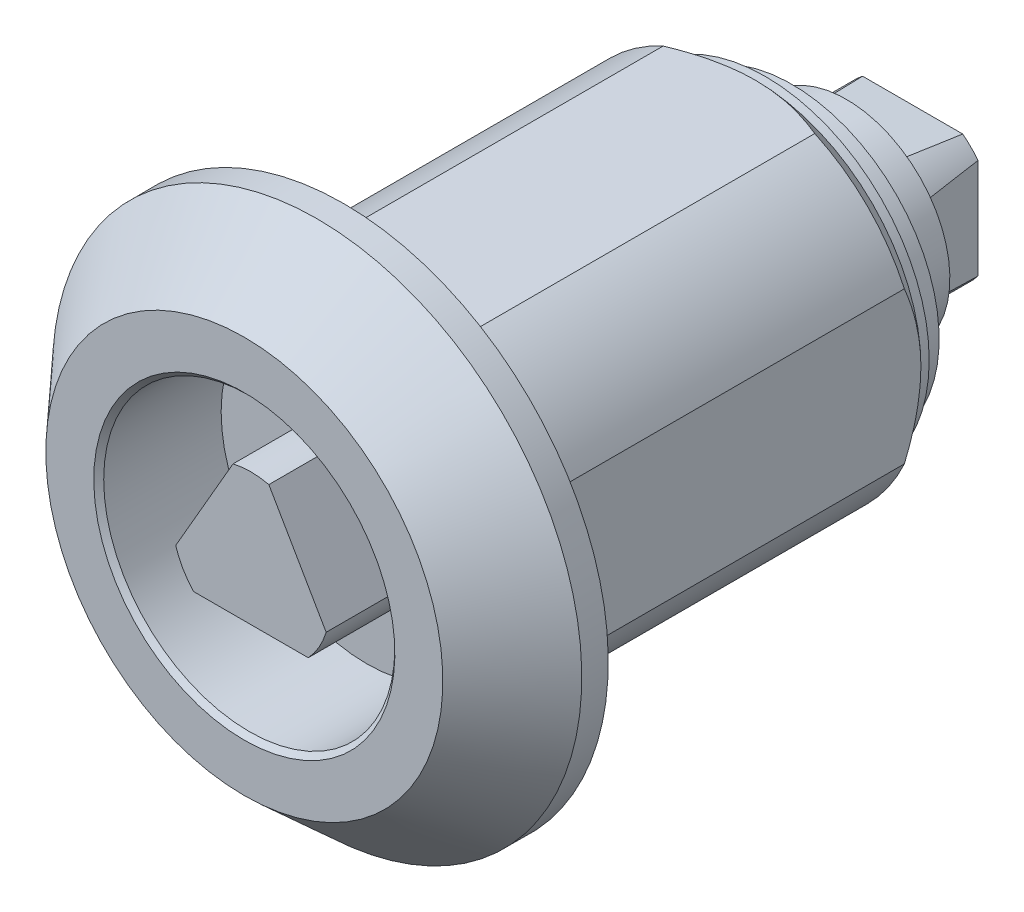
ISO-10303-21;
HEADER;
FILE_DESCRIPTION(('STEP AP214'),'2;1');
FILE_NAME('part.step','',(''),(''),'','','');
FILE_SCHEMA(('AUTOMOTIVE_DESIGN { 1 0 10303 214 1 1 1 1 }'));
ENDSEC;
DATA;
#1=APPLICATION_CONTEXT('core data for automotive mechanical design processes');
#2=APPLICATION_PROTOCOL_DEFINITION('international standard','automotive_design',2000,#1);
#3=PRODUCT_CONTEXT('',#1,'mechanical');
#4=PRODUCT('Part','Part','',(#3));
#5=PRODUCT_RELATED_PRODUCT_CATEGORY('part','',(#4));
#6=PRODUCT_DEFINITION_FORMATION('','',#4);
#7=PRODUCT_DEFINITION_CONTEXT('part definition',#1,'design');
#8=PRODUCT_DEFINITION('design','',#6,#7);
#9=PRODUCT_DEFINITION_SHAPE('','',#8);
#10=(LENGTH_UNIT() NAMED_UNIT(*) SI_UNIT(.MILLI.,.METRE.));
#11=(NAMED_UNIT(*) PLANE_ANGLE_UNIT() SI_UNIT($,.RADIAN.));
#12=(NAMED_UNIT(*) SI_UNIT($,.STERADIAN.) SOLID_ANGLE_UNIT());
#13=UNCERTAINTY_MEASURE_WITH_UNIT(LENGTH_MEASURE(1.E-05),#10,'distance_accuracy_value','');
#14=(GEOMETRIC_REPRESENTATION_CONTEXT(3) GLOBAL_UNCERTAINTY_ASSIGNED_CONTEXT((#13)) GLOBAL_UNIT_ASSIGNED_CONTEXT((#10,
#11,#12)) REPRESENTATION_CONTEXT('',''));
#15=CARTESIAN_POINT('',(0.,0.,0.));
#16=DIRECTION('',(0.,0.,1.));
#17=DIRECTION('',(1.,0.,0.));
#18=AXIS2_PLACEMENT_3D('',#15,#16,#17);
#19=CARTESIAN_POINT('',(0.,0.,-33.4));
#20=DIRECTION('',(0.,0.,-1.));
#21=DIRECTION('',(0.,-1.,0.));
#22=AXIS2_PLACEMENT_3D('',#19,#20,#21);
#23=PLANE('',#22);
#24=CARTESIAN_POINT('',(0.,0.,-33.4));
#25=DIRECTION('',(0.,0.,-1.));
#26=DIRECTION('',(0.,-1.,0.));
#27=AXIS2_PLACEMENT_3D('',#24,#25,#26);
#28=CIRCLE('',#27,2.5);
#29=CARTESIAN_POINT('',(0.,-2.5,-33.4));
#30=VERTEX_POINT('',#29);
#31=EDGE_CURVE('E22',#30,#30,#28,.F.);
#32=ORIENTED_EDGE('',*,*,#31,.T.);
#33=EDGE_LOOP('',(#32));
#34=FACE_BOUND('',#33,.T.);
#35=CARTESIAN_POINT('',(0.,0.,-33.4));
#36=DIRECTION('',(0.,0.,-1.));
#37=DIRECTION('',(0.,-1.,0.));
#38=AXIS2_PLACEMENT_3D('',#35,#36,#37);
#39=CIRCLE('',#38,3.05);
#40=CARTESIAN_POINT('',(0.,-3.05,-33.4));
#41=VERTEX_POINT('',#40);
#42=EDGE_CURVE('E536',#41,#41,#39,.T.);
#43=ORIENTED_EDGE('',*,*,#42,.T.);
#44=EDGE_LOOP('',(#43));
#45=FACE_BOUND('',#44,.T.);
#46=ADVANCED_FACE('F14',(#34,#45),#23,.T.);
#47=CARTESIAN_POINT('',(0.,0.,-34.4));
#48=DIRECTION('',(0.,0.,-1.));
#49=DIRECTION('',(0.,-1.,0.));
#50=AXIS2_PLACEMENT_3D('',#47,#48,#49);
#51=CYLINDRICAL_SURFACE('',#50,2.5);
#52=CARTESIAN_POINT('',(0.,0.,-26.9));
#53=DIRECTION('',(0.,0.,-1.));
#54=DIRECTION('',(-1.,0.,0.));
#55=AXIS2_PLACEMENT_3D('',#52,#53,#54);
#56=CIRCLE('',#55,2.5);
#57=CARTESIAN_POINT('',(-2.5,0.,-26.9));
#58=VERTEX_POINT('',#57);
#59=EDGE_CURVE('E516',#58,#58,#56,.F.);
#60=ORIENTED_EDGE('',*,*,#59,.T.);
#61=EDGE_LOOP('',(#60));
#62=FACE_BOUND('',#61,.T.);
#63=ORIENTED_EDGE('',*,*,#31,.F.);
#64=EDGE_LOOP('',(#63));
#65=FACE_BOUND('',#64,.T.);
#66=ADVANCED_FACE('F448',(#62,#65),#51,.F.);
#67=CARTESIAN_POINT('',(0.,0.,-34.4));
#68=DIRECTION('',(0.,0.,-1.));
#69=DIRECTION('',(0.,-1.,0.));
#70=AXIS2_PLACEMENT_3D('',#67,#68,#69);
#71=CYLINDRICAL_SURFACE('',#70,3.05);
#72=CARTESIAN_POINT('',(0.,0.,-34.4));
#73=DIRECTION('',(0.,0.,-1.));
#74=DIRECTION('',(0.,-1.,0.));
#75=AXIS2_PLACEMENT_3D('',#72,#73,#74);
#76=CIRCLE('',#75,3.05);
#77=CARTESIAN_POINT('',(0.,-3.05,-34.4));
#78=VERTEX_POINT('',#77);
#79=EDGE_CURVE('E545',#78,#78,#76,.F.);
#80=ORIENTED_EDGE('',*,*,#79,.F.);
#81=EDGE_LOOP('',(#80));
#82=FACE_BOUND('',#81,.T.);
#83=ORIENTED_EDGE('',*,*,#42,.F.);
#84=EDGE_LOOP('',(#83));
#85=FACE_BOUND('',#84,.T.);
#86=ADVANCED_FACE('F451',(#82,#85),#71,.F.);
#87=CARTESIAN_POINT('',(4.2,5.97,-30.7));
#88=DIRECTION('',(0.,0.,1.));
#89=DIRECTION('',(0.,1.,0.));
#90=AXIS2_PLACEMENT_3D('',#87,#88,#89);
#91=PLANE('',#90);
#92=CARTESIAN_POINT('',(0.,0.,-30.7));
#93=DIRECTION('',(0.,0.,-1.));
#94=DIRECTION('',(0.,-1.,0.));
#95=AXIS2_PLACEMENT_3D('',#92,#93,#94);
#96=CIRCLE('',#95,4.975);
#97=CARTESIAN_POINT('',(4.2,-2.66657551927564,-30.7));
#98=VERTEX_POINT('',#97);
#99=CARTESIAN_POINT('',(4.2,2.66657551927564,-30.7));
#100=VERTEX_POINT('',#99);
#101=EDGE_CURVE('E585',#98,#100,#96,.F.);
#102=ORIENTED_EDGE('',*,*,#101,.F.);
#103=DIRECTION('',(0.,-1.,0.));
#104=VECTOR('',#103,1.);
#105=CARTESIAN_POINT('',(4.2,5.97,-30.7));
#106=LINE('',#105,#104);
#107=EDGE_CURVE('E604',#98,#100,#106,.F.);
#108=ORIENTED_EDGE('',*,*,#107,.T.);
#109=EDGE_LOOP('',(#102,#108));
#110=FACE_BOUND('',#109,.T.);
#111=ADVANCED_FACE('F458',(#110),#91,.F.);
#112=CARTESIAN_POINT('',(3.95,5.97,-34.4));
#113=DIRECTION('',(-0.997725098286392,0.,0.0674138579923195));
#114=DIRECTION('',(-0.0674138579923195,0.,-0.997725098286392));
#115=AXIS2_PLACEMENT_3D('',#112,#113,#114);
#116=PLANE('',#115);
#117=ORIENTED_EDGE('',*,*,#107,.F.);
#118=CARTESIAN_POINT('',(0.,0.,-92.8600000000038));
#119=DIRECTION('',(-0.997725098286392,0.,0.0674138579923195));
#120=DIRECTION('',(-0.0674138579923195,0.,-0.997725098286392));
#121=AXIS2_PLACEMENT_3D('',#118,#119,#120);
#122=ELLIPSE('',#121,73.7978829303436,4.975);
#123=CARTESIAN_POINT('',(3.95,-3.02458674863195,-34.4));
#124=VERTEX_POINT('',#123);
#125=EDGE_CURVE('E582',#124,#98,#122,.T.);
#126=ORIENTED_EDGE('',*,*,#125,.F.);
#127=DIRECTION('',(0.,-1.,0.));
#128=VECTOR('',#127,1.);
#129=CARTESIAN_POINT('',(3.95,5.97,-34.4));
#130=LINE('',#129,#128);
#131=CARTESIAN_POINT('',(3.95,3.02458674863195,-34.4));
#132=VERTEX_POINT('',#131);
#133=EDGE_CURVE('E601',#132,#124,#130,.T.);
#134=ORIENTED_EDGE('',*,*,#133,.F.);
#135=CARTESIAN_POINT('',(0.,0.,-92.8600000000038));
#136=DIRECTION('',(-0.997725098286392,0.,0.0674138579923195));
#137=DIRECTION('',(-0.0674138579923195,0.,-0.997725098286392));
#138=AXIS2_PLACEMENT_3D('',#135,#136,#137);
#139=ELLIPSE('',#138,73.7978829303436,4.975);
#140=EDGE_CURVE('E588',#100,#132,#139,.T.);
#141=ORIENTED_EDGE('',*,*,#140,.F.);
#142=EDGE_LOOP('',(#117,#126,#134,#141));
#143=FACE_BOUND('',#142,.T.);
#144=ADVANCED_FACE('F482',(#143),#116,.F.);
#145=CARTESIAN_POINT('',(-5.97,-4.975,-30.7));
#146=DIRECTION('',(0.,0.,1.));
#147=DIRECTION('',(0.,1.,0.));
#148=AXIS2_PLACEMENT_3D('',#145,#146,#147);
#149=PLANE('',#148);
#150=DIRECTION('',(-1.,0.,0.));
#151=VECTOR('',#150,1.);
#152=CARTESIAN_POINT('',(-5.97,-4.2,-30.7));
#153=LINE('',#152,#151);
#154=CARTESIAN_POINT('',(-2.66657551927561,-4.2,-30.7));
#155=VERTEX_POINT('',#154);
#156=CARTESIAN_POINT('',(2.66657551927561,-4.2,-30.7));
#157=VERTEX_POINT('',#156);
#158=EDGE_CURVE('E568',#155,#157,#153,.F.);
#159=ORIENTED_EDGE('',*,*,#158,.T.);
#160=CARTESIAN_POINT('',(0.,0.,-30.7));
#161=DIRECTION('',(0.,0.,-1.));
#162=DIRECTION('',(0.,-1.,0.));
#163=AXIS2_PLACEMENT_3D('',#160,#161,#162);
#164=CIRCLE('',#163,4.975);
#165=CARTESIAN_POINT('',(0.999999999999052,-4.87346129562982,-30.7));
#166=VERTEX_POINT('',#165);
#167=EDGE_CURVE('E576',#166,#157,#164,.F.);
#168=ORIENTED_EDGE('',*,*,#167,.F.);
#169=DIRECTION('',(-1.,0.,0.));
#170=VECTOR('',#169,1.);
#171=CARTESIAN_POINT('',(-1.,-4.87346129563,-30.7));
#172=LINE('',#171,#170);
#173=CARTESIAN_POINT('',(-0.999999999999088,-4.87346129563,-30.7));
#174=VERTEX_POINT('',#173);
#175=EDGE_CURVE('E512',#166,#174,#172,.T.);
#176=ORIENTED_EDGE('',*,*,#175,.T.);
#177=CARTESIAN_POINT('',(0.,0.,-30.7));
#178=DIRECTION('',(0.,0.,-1.));
#179=DIRECTION('',(0.,-1.,0.));
#180=AXIS2_PLACEMENT_3D('',#177,#178,#179);
#181=CIRCLE('',#180,4.975);
#182=EDGE_CURVE('E563',#155,#174,#181,.F.);
#183=ORIENTED_EDGE('',*,*,#182,.F.);
#184=EDGE_LOOP('',(#159,#168,#176,#183));
#185=FACE_BOUND('',#184,.T.);
#186=ADVANCED_FACE('F479',(#185),#149,.F.);
#187=CARTESIAN_POINT('',(-5.97,-4.2,-30.7));
#188=DIRECTION('',(0.,0.997725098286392,0.0674138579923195));
#189=DIRECTION('',(0.,0.0674138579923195,-0.997725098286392));
#190=AXIS2_PLACEMENT_3D('',#187,#188,#189);
#191=PLANE('',#190);
#192=ORIENTED_EDGE('',*,*,#158,.F.);
#193=CARTESIAN_POINT('',(0.,0.,-92.860000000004));
#194=DIRECTION('',(0.,0.997725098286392,0.0674138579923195));
#195=DIRECTION('',(0.,0.0674138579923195,-0.997725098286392));
#196=AXIS2_PLACEMENT_3D('',#193,#194,#195);
#197=ELLIPSE('',#196,73.7978829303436,4.975);
#198=CARTESIAN_POINT('',(-3.02458674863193,-3.95,-34.4));
#199=VERTEX_POINT('',#198);
#200=EDGE_CURVE('E566',#199,#155,#197,.T.);
#201=ORIENTED_EDGE('',*,*,#200,.F.);
#202=DIRECTION('',(-1.,0.,0.));
#203=VECTOR('',#202,1.);
#204=CARTESIAN_POINT('',(-5.97,-3.95,-34.4));
#205=LINE('',#204,#203);
#206=CARTESIAN_POINT('',(3.02458674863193,-3.95,-34.4));
#207=VERTEX_POINT('',#206);
#208=EDGE_CURVE('E565',#207,#199,#205,.T.);
#209=ORIENTED_EDGE('',*,*,#208,.F.);
#210=CARTESIAN_POINT('',(0.,0.,-92.860000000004));
#211=DIRECTION('',(0.,0.997725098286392,0.0674138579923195));
#212=DIRECTION('',(0.,0.0674138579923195,-0.997725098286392));
#213=AXIS2_PLACEMENT_3D('',#210,#211,#212);
#214=ELLIPSE('',#213,73.7978829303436,4.975);
#215=EDGE_CURVE('E579',#157,#207,#214,.T.);
#216=ORIENTED_EDGE('',*,*,#215,.F.);
#217=EDGE_LOOP('',(#192,#201,#209,#216));
#218=FACE_BOUND('',#217,.T.);
#219=ADVANCED_FACE('F464',(#218),#191,.F.);
#220=CARTESIAN_POINT('',(-4.975,5.97,-30.7));
#221=DIRECTION('',(0.,0.,1.));
#222=DIRECTION('',(0.,1.,0.));
#223=AXIS2_PLACEMENT_3D('',#220,#221,#222);
#224=PLANE('',#223);
#225=CARTESIAN_POINT('',(0.,0.,-30.7));
#226=DIRECTION('',(0.,0.,-1.));
#227=DIRECTION('',(0.,-1.,0.));
#228=AXIS2_PLACEMENT_3D('',#225,#226,#227);
#229=CIRCLE('',#228,4.975);
#230=CARTESIAN_POINT('',(-4.2,2.66657551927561,-30.7));
#231=VERTEX_POINT('',#230);
#232=CARTESIAN_POINT('',(-4.2,-2.66657551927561,-30.7));
#233=VERTEX_POINT('',#232);
#234=EDGE_CURVE('E554',#231,#233,#229,.F.);
#235=ORIENTED_EDGE('',*,*,#234,.F.);
#236=DIRECTION('',(0.,-1.,0.));
#237=VECTOR('',#236,1.);
#238=CARTESIAN_POINT('',(-4.2,5.97,-30.7));
#239=LINE('',#238,#237);
#240=EDGE_CURVE('E539',#231,#233,#239,.T.);
#241=ORIENTED_EDGE('',*,*,#240,.T.);
#242=EDGE_LOOP('',(#235,#241));
#243=FACE_BOUND('',#242,.T.);
#244=ADVANCED_FACE('F460',(#243),#224,.F.);
#245=CARTESIAN_POINT('',(-4.2,5.97,-30.7));
#246=DIRECTION('',(0.997725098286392,0.,0.0674138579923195));
#247=DIRECTION('',(-0.0674138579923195,0.,0.997725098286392));
#248=AXIS2_PLACEMENT_3D('',#245,#246,#247);
#249=PLANE('',#248);
#250=ORIENTED_EDGE('',*,*,#240,.F.);
#251=CARTESIAN_POINT('',(0.,0.,-92.860000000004));
#252=DIRECTION('',(0.997725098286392,0.,0.0674138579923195));
#253=DIRECTION('',(0.0674138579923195,0.,-0.997725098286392));
#254=AXIS2_PLACEMENT_3D('',#251,#252,#253);
#255=ELLIPSE('',#254,73.7978829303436,4.975);
#256=CARTESIAN_POINT('',(-3.95,3.02458674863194,-34.4));
#257=VERTEX_POINT('',#256);
#258=EDGE_CURVE('E551',#257,#231,#255,.T.);
#259=ORIENTED_EDGE('',*,*,#258,.F.);
#260=DIRECTION('',(0.,-1.,0.));
#261=VECTOR('',#260,1.);
#262=CARTESIAN_POINT('',(-3.95,0.,-34.4));
#263=LINE('',#262,#261);
#264=CARTESIAN_POINT('',(-3.95,-3.02458674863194,-34.4));
#265=VERTEX_POINT('',#264);
#266=EDGE_CURVE('E544',#265,#257,#263,.F.);
#267=ORIENTED_EDGE('',*,*,#266,.F.);
#268=CARTESIAN_POINT('',(0.,0.,-92.860000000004));
#269=DIRECTION('',(0.997725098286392,0.,0.0674138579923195));
#270=DIRECTION('',(0.0674138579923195,0.,-0.997725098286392));
#271=AXIS2_PLACEMENT_3D('',#268,#269,#270);
#272=ELLIPSE('',#271,73.7978829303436,4.975);
#273=EDGE_CURVE('E557',#233,#265,#272,.T.);
#274=ORIENTED_EDGE('',*,*,#273,.F.);
#275=EDGE_LOOP('',(#250,#259,#267,#274));
#276=FACE_BOUND('',#275,.T.);
#277=ADVANCED_FACE('F463',(#276),#249,.F.);
#278=CARTESIAN_POINT('',(0.,0.,-34.4));
#279=DIRECTION('',(0.,0.,-1.));
#280=DIRECTION('',(0.,-1.,0.));
#281=AXIS2_PLACEMENT_3D('',#278,#279,#280);
#282=PLANE('',#281);
#283=ORIENTED_EDGE('',*,*,#79,.T.);
#284=EDGE_LOOP('',(#283));
#285=FACE_BOUND('',#284,.T.);
#286=CARTESIAN_POINT('',(0.,0.,-34.4));
#287=DIRECTION('',(0.,0.,-1.));
#288=DIRECTION('',(0.,-1.,0.));
#289=AXIS2_PLACEMENT_3D('',#286,#287,#288);
#290=CIRCLE('',#289,4.975);
#291=EDGE_CURVE('E560',#265,#199,#290,.F.);
#292=ORIENTED_EDGE('',*,*,#291,.F.);
#293=ORIENTED_EDGE('',*,*,#266,.T.);
#294=CARTESIAN_POINT('',(0.,0.,-34.4));
#295=DIRECTION('',(0.,0.,-1.));
#296=DIRECTION('',(0.,-1.,0.));
#297=AXIS2_PLACEMENT_3D('',#294,#295,#296);
#298=CIRCLE('',#297,4.975);
#299=CARTESIAN_POINT('',(-3.02458674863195,3.95,-34.4));
#300=VERTEX_POINT('',#299);
#301=EDGE_CURVE('E548',#300,#257,#298,.F.);
#302=ORIENTED_EDGE('',*,*,#301,.F.);
#303=DIRECTION('',(-1.,0.,0.));
#304=VECTOR('',#303,1.);
#305=CARTESIAN_POINT('',(-5.97,3.95,-34.4));
#306=LINE('',#305,#304);
#307=CARTESIAN_POINT('',(3.02458674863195,3.95,-34.4));
#308=VERTEX_POINT('',#307);
#309=EDGE_CURVE('E572',#300,#308,#306,.F.);
#310=ORIENTED_EDGE('',*,*,#309,.T.);
#311=CARTESIAN_POINT('',(0.,0.,-34.4));
#312=DIRECTION('',(0.,0.,-1.));
#313=DIRECTION('',(0.,-1.,0.));
#314=AXIS2_PLACEMENT_3D('',#311,#312,#313);
#315=CIRCLE('',#314,4.975);
#316=EDGE_CURVE('E540',#308,#132,#315,.T.);
#317=ORIENTED_EDGE('',*,*,#316,.T.);
#318=ORIENTED_EDGE('',*,*,#133,.T.);
#319=CARTESIAN_POINT('',(0.,0.,-34.4));
#320=DIRECTION('',(0.,0.,-1.));
#321=DIRECTION('',(0.,-1.,0.));
#322=AXIS2_PLACEMENT_3D('',#319,#320,#321);
#323=CIRCLE('',#322,4.975);
#324=EDGE_CURVE('E542',#124,#207,#323,.T.);
#325=ORIENTED_EDGE('',*,*,#324,.T.);
#326=ORIENTED_EDGE('',*,*,#208,.T.);
#327=EDGE_LOOP('',(#292,#293,#302,#310,#317,#318,#325,#326));
#328=FACE_BOUND('',#327,.T.);
#329=ADVANCED_FACE('F468',(#285,#328),#282,.T.);
#330=CARTESIAN_POINT('',(-5.97,3.95,-34.4));
#331=DIRECTION('',(0.,-0.997725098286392,0.0674138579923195));
#332=DIRECTION('',(0.,0.0674138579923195,0.997725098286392));
#333=AXIS2_PLACEMENT_3D('',#330,#331,#332);
#334=PLANE('',#333);
#335=DIRECTION('',(-1.,0.,0.));
#336=VECTOR('',#335,1.);
#337=CARTESIAN_POINT('',(-5.97,4.2,-30.7));
#338=LINE('',#337,#336);
#339=CARTESIAN_POINT('',(-2.66657551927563,4.2,-30.7));
#340=VERTEX_POINT('',#339);
#341=CARTESIAN_POINT('',(2.66657551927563,4.2,-30.7));
#342=VERTEX_POINT('',#341);
#343=EDGE_CURVE('E575',#340,#342,#338,.F.);
#344=ORIENTED_EDGE('',*,*,#343,.T.);
#345=CARTESIAN_POINT('',(0.,0.,-92.8600000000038));
#346=DIRECTION('',(0.,-0.997725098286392,0.0674138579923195));
#347=DIRECTION('',(0.,-0.0674138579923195,-0.997725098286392));
#348=AXIS2_PLACEMENT_3D('',#345,#346,#347);
#349=ELLIPSE('',#348,73.7978829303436,4.975);
#350=EDGE_CURVE('E591',#308,#342,#349,.T.);
#351=ORIENTED_EDGE('',*,*,#350,.F.);
#352=ORIENTED_EDGE('',*,*,#309,.F.);
#353=CARTESIAN_POINT('',(0.,0.,-92.8600000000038));
#354=DIRECTION('',(0.,-0.997725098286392,0.0674138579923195));
#355=DIRECTION('',(0.,-0.0674138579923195,-0.997725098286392));
#356=AXIS2_PLACEMENT_3D('',#353,#354,#355);
#357=ELLIPSE('',#356,73.7978829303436,4.975);
#358=EDGE_CURVE('E569',#340,#300,#357,.T.);
#359=ORIENTED_EDGE('',*,*,#358,.F.);
#360=EDGE_LOOP('',(#344,#351,#352,#359));
#361=FACE_BOUND('',#360,.T.);
#362=ADVANCED_FACE('F472',(#361),#334,.F.);
#363=CARTESIAN_POINT('',(-5.97,4.2,-30.7));
#364=DIRECTION('',(0.,0.,1.));
#365=DIRECTION('',(0.,1.,0.));
#366=AXIS2_PLACEMENT_3D('',#363,#364,#365);
#367=PLANE('',#366);
#368=ORIENTED_EDGE('',*,*,#343,.F.);
#369=CARTESIAN_POINT('',(0.,0.,-30.7));
#370=DIRECTION('',(0.,0.,-1.));
#371=DIRECTION('',(0.,-1.,0.));
#372=AXIS2_PLACEMENT_3D('',#369,#370,#371);
#373=CIRCLE('',#372,4.975);
#374=CARTESIAN_POINT('',(-0.999999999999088,4.87346129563,-30.7));
#375=VERTEX_POINT('',#374);
#376=EDGE_CURVE('E573',#375,#340,#373,.F.);
#377=ORIENTED_EDGE('',*,*,#376,.F.);
#378=DIRECTION('',(-1.,0.,0.));
#379=VECTOR('',#378,1.);
#380=CARTESIAN_POINT('',(1.,4.87346129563,-30.7));
#381=LINE('',#380,#379);
#382=CARTESIAN_POINT('',(0.99999999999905,4.87346129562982,-30.7));
#383=VERTEX_POINT('',#382);
#384=EDGE_CURVE('E610',#375,#383,#381,.F.);
#385=ORIENTED_EDGE('',*,*,#384,.T.);
#386=CARTESIAN_POINT('',(0.,0.,-30.7));
#387=DIRECTION('',(0.,0.,-1.));
#388=DIRECTION('',(0.,-1.,0.));
#389=AXIS2_PLACEMENT_3D('',#386,#387,#388);
#390=CIRCLE('',#389,4.975);
#391=EDGE_CURVE('E594',#342,#383,#390,.F.);
#392=ORIENTED_EDGE('',*,*,#391,.F.);
#393=EDGE_LOOP('',(#368,#377,#385,#392));
#394=FACE_BOUND('',#393,.T.);
#395=ADVANCED_FACE('F495',(#394),#367,.F.);
#396=CARTESIAN_POINT('',(1.,4.87346129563,-30.7));
#397=DIRECTION('',(0.,-1.,0.));
#398=DIRECTION('',(0.,0.,1.));
#399=AXIS2_PLACEMENT_3D('',#396,#397,#398);
#400=PLANE('',#399);
#401=DIRECTION('',(0.,0.,1.));
#402=VECTOR('',#401,1.);
#403=CARTESIAN_POINT('',(-1.,4.87346129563,-30.7));
#404=LINE('',#403,#402);
#405=CARTESIAN_POINT('',(-1.,4.87346129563,-30.4));
#406=VERTEX_POINT('',#405);
#407=EDGE_CURVE('E609',#406,#375,#404,.F.);
#408=ORIENTED_EDGE('',*,*,#407,.F.);
#409=DIRECTION('',(1.,0.,0.));
#410=VECTOR('',#409,1.);
#411=CARTESIAN_POINT('',(1.,4.87346129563,-30.4));
#412=LINE('',#411,#410);
#413=CARTESIAN_POINT('',(0.999999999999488,4.87346129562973,-30.4));
#414=VERTEX_POINT('',#413);
#415=EDGE_CURVE('E522',#406,#414,#412,.T.);
#416=ORIENTED_EDGE('',*,*,#415,.T.);
#417=DIRECTION('',(0.,0.,-1.));
#418=VECTOR('',#417,1.);
#419=CARTESIAN_POINT('',(0.999999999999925,4.87346129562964,-11.3));
#420=LINE('',#419,#418);
#421=EDGE_CURVE('E515',#383,#414,#420,.F.);
#422=ORIENTED_EDGE('',*,*,#421,.F.);
#423=ORIENTED_EDGE('',*,*,#384,.F.);
#424=EDGE_LOOP('',(#408,#416,#422,#423));
#425=FACE_BOUND('',#424,.T.);
#426=ADVANCED_FACE('F478',(#425),#400,.F.);
#427=CARTESIAN_POINT('',(0.,0.,-11.3));
#428=DIRECTION('',(0.,0.,-1.));
#429=DIRECTION('',(0.,-1.,0.));
#430=AXIS2_PLACEMENT_3D('',#427,#428,#429);
#431=CYLINDRICAL_SURFACE('',#430,4.975);
#432=CARTESIAN_POINT('',(0.,0.,-30.4));
#433=DIRECTION('',(0.,0.,-1.));
#434=DIRECTION('',(-1.,0.,0.));
#435=AXIS2_PLACEMENT_3D('',#432,#433,#434);
#436=CIRCLE('',#435,4.975);
#437=CARTESIAN_POINT('',(-1.,-4.87346129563,-30.4));
#438=VERTEX_POINT('',#437);
#439=EDGE_CURVE('E29',#406,#438,#436,.F.);
#440=ORIENTED_EDGE('',*,*,#439,.F.);
#441=ORIENTED_EDGE('',*,*,#407,.T.);
#442=ORIENTED_EDGE('',*,*,#376,.T.);
#443=ORIENTED_EDGE('',*,*,#358,.T.);
#444=ORIENTED_EDGE('',*,*,#301,.T.);
#445=ORIENTED_EDGE('',*,*,#258,.T.);
#446=ORIENTED_EDGE('',*,*,#234,.T.);
#447=ORIENTED_EDGE('',*,*,#273,.T.);
#448=ORIENTED_EDGE('',*,*,#291,.T.);
#449=ORIENTED_EDGE('',*,*,#200,.T.);
#450=ORIENTED_EDGE('',*,*,#182,.T.);
#451=DIRECTION('',(0.,0.,-1.));
#452=VECTOR('',#451,1.);
#453=CARTESIAN_POINT('',(-1.,-4.87346129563,-30.7));
#454=LINE('',#453,#452);
#455=EDGE_CURVE('E578',#174,#438,#454,.F.);
#456=ORIENTED_EDGE('',*,*,#455,.T.);
#457=EDGE_LOOP('',(#440,#441,#442,#443,#444,#445,#446,#447,#448,#449,#450,#456));
#458=FACE_BOUND('',#457,.T.);
#459=ADVANCED_FACE('F474',(#458),#431,.T.);
#460=CARTESIAN_POINT('',(-1.,-4.87346129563,-30.7));
#461=DIRECTION('',(0.,1.,0.));
#462=DIRECTION('',(0.,0.,-1.));
#463=AXIS2_PLACEMENT_3D('',#460,#461,#462);
#464=PLANE('',#463);
#465=DIRECTION('',(0.,0.,-1.));
#466=VECTOR('',#465,1.);
#467=CARTESIAN_POINT('',(0.999999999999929,-4.87346129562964,-11.3));
#468=LINE('',#467,#466);
#469=CARTESIAN_POINT('',(0.999999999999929,-4.87346129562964,-30.4));
#470=VERTEX_POINT('',#469);
#471=EDGE_CURVE('E510',#470,#166,#468,.T.);
#472=ORIENTED_EDGE('',*,*,#471,.F.);
#473=DIRECTION('',(-1.,0.,0.));
#474=VECTOR('',#473,1.);
#475=CARTESIAN_POINT('',(-1.,-4.87346129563,-30.4));
#476=LINE('',#475,#474);
#477=EDGE_CURVE('E37',#470,#438,#476,.T.);
#478=ORIENTED_EDGE('',*,*,#477,.T.);
#479=ORIENTED_EDGE('',*,*,#455,.F.);
#480=ORIENTED_EDGE('',*,*,#175,.F.);
#481=EDGE_LOOP('',(#472,#478,#479,#480));
#482=FACE_BOUND('',#481,.T.);
#483=ADVANCED_FACE('F477',(#482),#464,.F.);
#484=CARTESIAN_POINT('',(0.,0.,-11.3));
#485=DIRECTION('',(0.,0.,-1.));
#486=DIRECTION('',(0.,-1.,0.));
#487=AXIS2_PLACEMENT_3D('',#484,#485,#486);
#488=CYLINDRICAL_SURFACE('',#487,4.975);
#489=CARTESIAN_POINT('',(0.,0.,-30.4));
#490=DIRECTION('',(0.,0.,-1.));
#491=DIRECTION('',(-1.,0.,0.));
#492=AXIS2_PLACEMENT_3D('',#489,#490,#491);
#493=CIRCLE('',#492,4.975);
#494=EDGE_CURVE('E9',#470,#414,#493,.F.);
#495=ORIENTED_EDGE('',*,*,#494,.F.);
#496=ORIENTED_EDGE('',*,*,#471,.T.);
#497=ORIENTED_EDGE('',*,*,#167,.T.);
#498=ORIENTED_EDGE('',*,*,#215,.T.);
#499=ORIENTED_EDGE('',*,*,#324,.F.);
#500=ORIENTED_EDGE('',*,*,#125,.T.);
#501=ORIENTED_EDGE('',*,*,#101,.T.);
#502=ORIENTED_EDGE('',*,*,#140,.T.);
#503=ORIENTED_EDGE('',*,*,#316,.F.);
#504=ORIENTED_EDGE('',*,*,#350,.T.);
#505=ORIENTED_EDGE('',*,*,#391,.T.);
#506=ORIENTED_EDGE('',*,*,#421,.T.);
#507=EDGE_LOOP('',(#495,#496,#497,#498,#499,#500,#501,#502,#503,#504,#505,#506));
#508=FACE_BOUND('',#507,.T.);
#509=ADVANCED_FACE('F16',(#508),#488,.T.);
#510=CARTESIAN_POINT('',(0.,-5.24829717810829,-30.4));
#511=DIRECTION('',(0.,0.,-1.));
#512=DIRECTION('',(-1.,0.,0.));
#513=AXIS2_PLACEMENT_3D('',#510,#511,#512);
#514=PLANE('',#513);
#515=ORIENTED_EDGE('',*,*,#415,.F.);
#516=ORIENTED_EDGE('',*,*,#439,.T.);
#517=ORIENTED_EDGE('',*,*,#477,.F.);
#518=ORIENTED_EDGE('',*,*,#494,.T.);
#519=EDGE_LOOP('',(#515,#516,#517,#518));
#520=FACE_BOUND('',#519,.T.);
#521=CARTESIAN_POINT('',(0.,0.,-30.4));
#522=DIRECTION('',(0.,0.,-1.));
#523=DIRECTION('',(0.,-1.,0.));
#524=AXIS2_PLACEMENT_3D('',#521,#522,#523);
#525=CIRCLE('',#524,6.25);
#526=CARTESIAN_POINT('',(0.,-6.25,-30.4));
#527=VERTEX_POINT('',#526);
#528=EDGE_CURVE('E648',#527,#527,#525,.T.);
#529=ORIENTED_EDGE('',*,*,#528,.T.);
#530=EDGE_LOOP('',(#529));
#531=FACE_BOUND('',#530,.T.);
#532=ADVANCED_FACE('F443',(#520,#531),#514,.T.);
#533=CARTESIAN_POINT('',(0.,-3.74428392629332,-26.9));
#534=DIRECTION('',(0.,0.,-1.));
#535=DIRECTION('',(-1.,0.,0.));
#536=AXIS2_PLACEMENT_3D('',#533,#534,#535);
#537=PLANE('',#536);
#538=ORIENTED_EDGE('',*,*,#59,.F.);
#539=EDGE_LOOP('',(#538));
#540=FACE_BOUND('',#539,.T.);
#541=ADVANCED_FACE('F431',(#540),#537,.T.);
#542=CARTESIAN_POINT('',(0.,0.,7.4));
#543=DIRECTION('',(0.,0.,-1.));
#544=DIRECTION('',(0.,-1.,0.));
#545=AXIS2_PLACEMENT_3D('',#542,#543,#544);
#546=CYLINDRICAL_SURFACE('',#545,6.6);
#547=CARTESIAN_POINT('',(0.,0.,-26.9));
#548=DIRECTION('',(0.,0.,-1.));
#549=DIRECTION('',(-1.,0.,0.));
#550=AXIS2_PLACEMENT_3D('',#547,#548,#549);
#551=CIRCLE('',#550,6.6);
#552=CARTESIAN_POINT('',(-6.6,0.,-26.9));
#553=VERTEX_POINT('',#552);
#554=EDGE_CURVE('E651',#553,#553,#551,.F.);
#555=ORIENTED_EDGE('',*,*,#554,.F.);
#556=EDGE_LOOP('',(#555));
#557=FACE_BOUND('',#556,.T.);
#558=CARTESIAN_POINT('',(0.,0.,-27.));
#559=DIRECTION('',(0.,0.,-1.));
#560=DIRECTION('',(0.,-1.,0.));
#561=AXIS2_PLACEMENT_3D('',#558,#559,#560);
#562=CIRCLE('',#561,6.6);
#563=CARTESIAN_POINT('',(0.,-6.6,-27.));
#564=VERTEX_POINT('',#563);
#565=EDGE_CURVE('E527',#564,#564,#562,.F.);
#566=ORIENTED_EDGE('',*,*,#565,.T.);
#567=EDGE_LOOP('',(#566));
#568=FACE_BOUND('',#567,.T.);
#569=ADVANCED_FACE('F429',(#557,#568),#546,.T.);
#570=CARTESIAN_POINT('',(0.,0.,7.4));
#571=DIRECTION('',(0.,0.,-1.));
#572=DIRECTION('',(0.,-1.,0.));
#573=AXIS2_PLACEMENT_3D('',#570,#571,#572);
#574=CYLINDRICAL_SURFACE('',#573,6.25);
#575=ORIENTED_EDGE('',*,*,#528,.F.);
#576=EDGE_LOOP('',(#575));
#577=FACE_BOUND('',#576,.T.);
#578=CARTESIAN_POINT('',(0.,0.,-28.));
#579=DIRECTION('',(0.,0.,-1.));
#580=DIRECTION('',(0.,-1.,0.));
#581=AXIS2_PLACEMENT_3D('',#578,#579,#580);
#582=CIRCLE('',#581,6.25);
#583=CARTESIAN_POINT('',(0.,-6.25,-28.));
#584=VERTEX_POINT('',#583);
#585=EDGE_CURVE('E645',#584,#584,#582,.T.);
#586=ORIENTED_EDGE('',*,*,#585,.T.);
#587=EDGE_LOOP('',(#586));
#588=FACE_BOUND('',#587,.T.);
#589=ADVANCED_FACE('F425',(#577,#588),#574,.T.);
#590=CARTESIAN_POINT('',(0.,0.,-28.));
#591=DIRECTION('',(0.,0.,-1.));
#592=DIRECTION('',(0.,-1.,0.));
#593=AXIS2_PLACEMENT_3D('',#590,#591,#592);
#594=PLANE('',#593);
#595=ORIENTED_EDGE('',*,*,#585,.F.);
#596=EDGE_LOOP('',(#595));
#597=FACE_BOUND('',#596,.T.);
#598=CARTESIAN_POINT('',(0.,0.,-28.));
#599=DIRECTION('',(0.,0.,-1.));
#600=DIRECTION('',(0.,-1.,0.));
#601=AXIS2_PLACEMENT_3D('',#598,#599,#600);
#602=CIRCLE('',#601,6.95);
#603=CARTESIAN_POINT('',(0.,-6.95,-28.));
#604=VERTEX_POINT('',#603);
#605=EDGE_CURVE('E289',#604,#604,#602,.F.);
#606=ORIENTED_EDGE('',*,*,#605,.F.);
#607=EDGE_LOOP('',(#606));
#608=FACE_BOUND('',#607,.T.);
#609=ADVANCED_FACE('F422',(#597,#608),#594,.T.);
#610=CARTESIAN_POINT('',(0.,0.,7.4));
#611=DIRECTION('',(0.,0.,-1.));
#612=DIRECTION('',(0.,-1.,0.));
#613=AXIS2_PLACEMENT_3D('',#610,#611,#612);
#614=CYLINDRICAL_SURFACE('',#613,6.95);
#615=ORIENTED_EDGE('',*,*,#605,.T.);
#616=EDGE_LOOP('',(#615));
#617=FACE_BOUND('',#616,.T.);
#618=CARTESIAN_POINT('',(0.,0.,-27.));
#619=DIRECTION('',(0.,0.,-1.));
#620=DIRECTION('',(0.,-1.,0.));
#621=AXIS2_PLACEMENT_3D('',#618,#619,#620);
#622=CIRCLE('',#621,6.95);
#623=CARTESIAN_POINT('',(0.,-6.95,-27.));
#624=VERTEX_POINT('',#623);
#625=EDGE_CURVE('E644',#624,#624,#622,.T.);
#626=ORIENTED_EDGE('',*,*,#625,.T.);
#627=EDGE_LOOP('',(#626));
#628=FACE_BOUND('',#627,.T.);
#629=ADVANCED_FACE('F421',(#617,#628),#614,.T.);
#630=CARTESIAN_POINT('',(0.,0.,-27.));
#631=DIRECTION('',(0.,0.,-1.));
#632=DIRECTION('',(0.,-1.,0.));
#633=AXIS2_PLACEMENT_3D('',#630,#631,#632);
#634=PLANE('',#633);
#635=ORIENTED_EDGE('',*,*,#565,.F.);
#636=EDGE_LOOP('',(#635));
#637=FACE_BOUND('',#636,.T.);
#638=ORIENTED_EDGE('',*,*,#625,.F.);
#639=EDGE_LOOP('',(#638));
#640=FACE_BOUND('',#639,.T.);
#641=ADVANCED_FACE('F414',(#637,#640),#634,.F.);
#642=CARTESIAN_POINT('',(0.,0.,5.6));
#643=DIRECTION('',(0.,0.,-1.));
#644=DIRECTION('',(1.,0.,0.));
#645=AXIS2_PLACEMENT_3D('',#642,#643,#644);
#646=PLANE('',#645);
#647=CARTESIAN_POINT('',(0.,0.,5.6));
#648=DIRECTION('',(0.,0.,1.));
#649=DIRECTION('',(-1.,0.,0.));
#650=AXIS2_PLACEMENT_3D('',#647,#648,#649);
#651=CIRCLE('',#650,4.75);
#652=CARTESIAN_POINT('',(-3.46410161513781,-3.24999999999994,5.6));
#653=VERTEX_POINT('',#652);
#654=CARTESIAN_POINT('',(-4.5466333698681,-1.37500000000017,5.6));
#655=VERTEX_POINT('',#654);
#656=EDGE_CURVE('E667',#653,#655,#651,.F.);
#657=ORIENTED_EDGE('',*,*,#656,.F.);
#658=DIRECTION('',(-1.,0.,0.));
#659=VECTOR('',#658,1.);
#660=CARTESIAN_POINT('',(3.464101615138,-3.25,5.6));
#661=LINE('',#660,#659);
#662=CARTESIAN_POINT('',(3.46410161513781,-3.24999999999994,5.6));
#663=VERTEX_POINT('',#662);
#664=EDGE_CURVE('E315',#653,#663,#661,.F.);
#665=ORIENTED_EDGE('',*,*,#664,.T.);
#666=CARTESIAN_POINT('',(0.,0.,5.6));
#667=DIRECTION('',(0.,0.,1.));
#668=DIRECTION('',(-1.,0.,0.));
#669=AXIS2_PLACEMENT_3D('',#666,#667,#668);
#670=CIRCLE('',#669,4.75);
#671=CARTESIAN_POINT('',(4.54663336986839,-1.3749999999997,5.6));
#672=VERTEX_POINT('',#671);
#673=EDGE_CURVE('E677',#672,#663,#670,.F.);
#674=ORIENTED_EDGE('',*,*,#673,.F.);
#675=DIRECTION('',(0.500000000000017,-0.866025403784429,0.));
#676=VECTOR('',#675,1.);
#677=CARTESIAN_POINT('',(1.082531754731,4.625,5.6));
#678=LINE('',#677,#676);
#679=CARTESIAN_POINT('',(1.08253175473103,4.62499999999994,5.6));
#680=VERTEX_POINT('',#679);
#681=EDGE_CURVE('E675',#672,#680,#678,.F.);
#682=ORIENTED_EDGE('',*,*,#681,.T.);
#683=CARTESIAN_POINT('',(0.,0.,5.6));
#684=DIRECTION('',(0.,0.,1.));
#685=DIRECTION('',(-1.,0.,0.));
#686=AXIS2_PLACEMENT_3D('',#683,#684,#685);
#687=CIRCLE('',#686,4.75);
#688=CARTESIAN_POINT('',(-1.0825317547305,4.625,5.6));
#689=VERTEX_POINT('',#688);
#690=EDGE_CURVE('E672',#689,#680,#687,.F.);
#691=ORIENTED_EDGE('',*,*,#690,.F.);
#692=DIRECTION('',(0.500000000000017,0.866025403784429,0.));
#693=VECTOR('',#692,1.);
#694=CARTESIAN_POINT('',(-4.546633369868,-1.375,5.6));
#695=LINE('',#694,#693);
#696=EDGE_CURVE('E670',#689,#655,#695,.F.);
#697=ORIENTED_EDGE('',*,*,#696,.T.);
#698=EDGE_LOOP('',(#657,#665,#674,#682,#691,#697));
#699=FACE_BOUND('',#698,.T.);
#700=ADVANCED_FACE('F400',(#699),#646,.F.);
#701=CARTESIAN_POINT('',(0.,0.,5.6));
#702=DIRECTION('',(0.,0.,1.));
#703=DIRECTION('',(-1.,0.,0.));
#704=AXIS2_PLACEMENT_3D('',#701,#702,#703);
#705=CYLINDRICAL_SURFACE('',#704,4.75);
#706=DIRECTION('',(0.,0.,1.));
#707=VECTOR('',#706,1.);
#708=CARTESIAN_POINT('',(1.082531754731,4.625,5.6));
#709=LINE('',#708,#707);
#710=CARTESIAN_POINT('',(1.08253175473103,4.62499999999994,-1.4));
#711=VERTEX_POINT('',#710);
#712=EDGE_CURVE('E698',#680,#711,#709,.F.);
#713=ORIENTED_EDGE('',*,*,#712,.T.);
#714=CARTESIAN_POINT('',(0.,0.,-1.4));
#715=DIRECTION('',(0.,0.,1.));
#716=DIRECTION('',(-1.,0.,0.));
#717=AXIS2_PLACEMENT_3D('',#714,#715,#716);
#718=CIRCLE('',#717,4.75);
#719=CARTESIAN_POINT('',(-1.08253175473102,4.62499999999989,-1.4));
#720=VERTEX_POINT('',#719);
#721=EDGE_CURVE('E687',#720,#711,#718,.F.);
#722=ORIENTED_EDGE('',*,*,#721,.F.);
#723=DIRECTION('',(0.,0.,1.));
#724=VECTOR('',#723,1.);
#725=CARTESIAN_POINT('',(-1.08253175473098,4.6249999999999,5.6));
#726=LINE('',#725,#724);
#727=EDGE_CURVE('E676',#720,#689,#726,.T.);
#728=ORIENTED_EDGE('',*,*,#727,.T.);
#729=ORIENTED_EDGE('',*,*,#690,.T.);
#730=EDGE_LOOP('',(#713,#722,#728,#729));
#731=FACE_BOUND('',#730,.T.);
#732=ADVANCED_FACE('F396',(#731),#705,.T.);
#733=CARTESIAN_POINT('',(-4.546633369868,-1.375,5.6));
#734=DIRECTION('',(0.866025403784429,-0.500000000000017,0.));
#735=DIRECTION('',(0.500000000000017,0.866025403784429,0.));
#736=AXIS2_PLACEMENT_3D('',#733,#734,#735);
#737=PLANE('',#736);
#738=DIRECTION('',(0.499999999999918,0.866025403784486,0.));
#739=VECTOR('',#738,1.);
#740=CARTESIAN_POINT('',(-4.546633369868,-1.375,-1.4));
#741=LINE('',#740,#739);
#742=CARTESIAN_POINT('',(-4.5466333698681,-1.37500000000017,-1.4));
#743=VERTEX_POINT('',#742);
#744=EDGE_CURVE('E685',#743,#720,#741,.T.);
#745=ORIENTED_EDGE('',*,*,#744,.F.);
#746=DIRECTION('',(0.,0.,1.));
#747=VECTOR('',#746,1.);
#748=CARTESIAN_POINT('',(-4.546633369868,-1.375,5.6));
#749=LINE('',#748,#747);
#750=EDGE_CURVE('E696',#655,#743,#749,.F.);
#751=ORIENTED_EDGE('',*,*,#750,.F.);
#752=ORIENTED_EDGE('',*,*,#696,.F.);
#753=ORIENTED_EDGE('',*,*,#727,.F.);
#754=EDGE_LOOP('',(#745,#751,#752,#753));
#755=FACE_BOUND('',#754,.T.);
#756=ADVANCED_FACE('F399',(#755),#737,.F.);
#757=CARTESIAN_POINT('',(0.,0.,5.6));
#758=DIRECTION('',(0.,0.,1.));
#759=DIRECTION('',(-1.,0.,0.));
#760=AXIS2_PLACEMENT_3D('',#757,#758,#759);
#761=CYLINDRICAL_SURFACE('',#760,4.75);
#762=ORIENTED_EDGE('',*,*,#750,.T.);
#763=CARTESIAN_POINT('',(0.,0.,-1.4));
#764=DIRECTION('',(0.,0.,1.));
#765=DIRECTION('',(-1.,0.,0.));
#766=AXIS2_PLACEMENT_3D('',#763,#764,#765);
#767=CIRCLE('',#766,4.75);
#768=CARTESIAN_POINT('',(-3.46410161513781,-3.24999999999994,-1.4));
#769=VERTEX_POINT('',#768);
#770=EDGE_CURVE('E682',#769,#743,#767,.F.);
#771=ORIENTED_EDGE('',*,*,#770,.F.);
#772=DIRECTION('',(0.,0.,1.));
#773=VECTOR('',#772,1.);
#774=CARTESIAN_POINT('',(-3.46410161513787,-3.24999999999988,5.6));
#775=LINE('',#774,#773);
#776=EDGE_CURVE('E671',#769,#653,#775,.T.);
#777=ORIENTED_EDGE('',*,*,#776,.T.);
#778=ORIENTED_EDGE('',*,*,#656,.T.);
#779=EDGE_LOOP('',(#762,#771,#777,#778));
#780=FACE_BOUND('',#779,.T.);
#781=ADVANCED_FACE('F404',(#780),#761,.T.);
#782=CARTESIAN_POINT('',(3.464101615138,-3.25,5.6));
#783=DIRECTION('',(0.,1.,0.));
#784=DIRECTION('',(0.,0.,-1.));
#785=AXIS2_PLACEMENT_3D('',#782,#783,#784);
#786=PLANE('',#785);
#787=DIRECTION('',(-1.,0.,0.));
#788=VECTOR('',#787,1.);
#789=CARTESIAN_POINT('',(0.,-3.25,-1.4));
#790=LINE('',#789,#788);
#791=CARTESIAN_POINT('',(3.46410161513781,-3.24999999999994,-1.4));
#792=VERTEX_POINT('',#791);
#793=EDGE_CURVE('E686',#792,#769,#790,.T.);
#794=ORIENTED_EDGE('',*,*,#793,.F.);
#795=DIRECTION('',(0.,0.,1.));
#796=VECTOR('',#795,1.);
#797=CARTESIAN_POINT('',(3.46410161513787,-3.24999999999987,5.6));
#798=LINE('',#797,#796);
#799=EDGE_CURVE('E680',#663,#792,#798,.F.);
#800=ORIENTED_EDGE('',*,*,#799,.F.);
#801=ORIENTED_EDGE('',*,*,#664,.F.);
#802=ORIENTED_EDGE('',*,*,#776,.F.);
#803=EDGE_LOOP('',(#794,#800,#801,#802));
#804=FACE_BOUND('',#803,.T.);
#805=ADVANCED_FACE('F391',(#804),#786,.F.);
#806=CARTESIAN_POINT('',(0.,0.,5.6));
#807=DIRECTION('',(0.,0.,1.));
#808=DIRECTION('',(-1.,0.,0.));
#809=AXIS2_PLACEMENT_3D('',#806,#807,#808);
#810=CYLINDRICAL_SURFACE('',#809,4.75);
#811=ORIENTED_EDGE('',*,*,#799,.T.);
#812=CARTESIAN_POINT('',(0.,0.,-1.4));
#813=DIRECTION('',(0.,0.,1.));
#814=DIRECTION('',(-1.,0.,0.));
#815=AXIS2_PLACEMENT_3D('',#812,#813,#814);
#816=CIRCLE('',#815,4.75);
#817=CARTESIAN_POINT('',(4.54663336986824,-1.37500000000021,-1.4));
#818=VERTEX_POINT('',#817);
#819=EDGE_CURVE('E691',#818,#792,#816,.F.);
#820=ORIENTED_EDGE('',*,*,#819,.F.);
#821=DIRECTION('',(0.,0.,1.));
#822=VECTOR('',#821,1.);
#823=CARTESIAN_POINT('',(4.54663336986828,-1.37500000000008,5.6));
#824=LINE('',#823,#822);
#825=EDGE_CURVE('E681',#818,#672,#824,.T.);
#826=ORIENTED_EDGE('',*,*,#825,.T.);
#827=ORIENTED_EDGE('',*,*,#673,.T.);
#828=EDGE_LOOP('',(#811,#820,#826,#827));
#829=FACE_BOUND('',#828,.T.);
#830=ADVANCED_FACE('F388',(#829),#810,.T.);
#831=CARTESIAN_POINT('',(1.082531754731,4.625,5.6));
#832=DIRECTION('',(-0.866025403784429,-0.500000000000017,0.));
#833=DIRECTION('',(0.500000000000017,-0.866025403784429,0.));
#834=AXIS2_PLACEMENT_3D('',#831,#832,#833);
#835=PLANE('',#834);
#836=DIRECTION('',(0.499999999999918,-0.866025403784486,0.));
#837=VECTOR('',#836,1.);
#838=CARTESIAN_POINT('',(1.082531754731,4.625,-1.4));
#839=LINE('',#838,#837);
#840=EDGE_CURVE('E690',#711,#818,#839,.T.);
#841=ORIENTED_EDGE('',*,*,#840,.F.);
#842=ORIENTED_EDGE('',*,*,#712,.F.);
#843=ORIENTED_EDGE('',*,*,#681,.F.);
#844=ORIENTED_EDGE('',*,*,#825,.F.);
#845=EDGE_LOOP('',(#841,#842,#843,#844));
#846=FACE_BOUND('',#845,.T.);
#847=ADVANCED_FACE('F386',(#846),#835,.F.);
#848=CARTESIAN_POINT('',(0.,0.,-1.4));
#849=DIRECTION('',(0.,0.,1.));
#850=DIRECTION('',(-1.,0.,0.));
#851=AXIS2_PLACEMENT_3D('',#848,#849,#850);
#852=PLANE('',#851);
#853=ORIENTED_EDGE('',*,*,#840,.T.);
#854=ORIENTED_EDGE('',*,*,#819,.T.);
#855=ORIENTED_EDGE('',*,*,#793,.T.);
#856=ORIENTED_EDGE('',*,*,#770,.T.);
#857=ORIENTED_EDGE('',*,*,#744,.T.);
#858=ORIENTED_EDGE('',*,*,#721,.T.);
#859=EDGE_LOOP('',(#853,#854,#855,#856,#857,#858));
#860=FACE_BOUND('',#859,.T.);
#861=CARTESIAN_POINT('',(0.,0.,-1.4));
#862=DIRECTION('',(0.,0.,-1.));
#863=DIRECTION('',(0.,1.,0.));
#864=AXIS2_PLACEMENT_3D('',#861,#862,#863);
#865=CIRCLE('',#864,8.8);
#866=CARTESIAN_POINT('',(0.,8.8,-1.4));
#867=VERTEX_POINT('',#866);
#868=EDGE_CURVE('E288',#867,#867,#865,.F.);
#869=ORIENTED_EDGE('',*,*,#868,.T.);
#870=EDGE_LOOP('',(#869));
#871=FACE_BOUND('',#870,.T.);
#872=ADVANCED_FACE('F382',(#860,#871),#852,.T.);
#873=CARTESIAN_POINT('',(0.,0.,7.575));
#874=DIRECTION('',(0.,0.,-1.));
#875=DIRECTION('',(0.,1.,0.));
#876=AXIS2_PLACEMENT_3D('',#873,#874,#875);
#877=CYLINDRICAL_SURFACE('',#876,8.8);
#878=CARTESIAN_POINT('',(0.,0.,5.7));
#879=DIRECTION('',(0.,0.,-1.));
#880=DIRECTION('',(0.,1.,0.));
#881=AXIS2_PLACEMENT_3D('',#878,#879,#880);
#882=CIRCLE('',#881,8.8);
#883=CARTESIAN_POINT('',(0.,8.8,5.7));
#884=VERTEX_POINT('',#883);
#885=EDGE_CURVE('E317',#884,#884,#882,.T.);
#886=ORIENTED_EDGE('',*,*,#885,.F.);
#887=EDGE_LOOP('',(#886));
#888=FACE_BOUND('',#887,.T.);
#889=ORIENTED_EDGE('',*,*,#868,.F.);
#890=EDGE_LOOP('',(#889));
#891=FACE_BOUND('',#890,.T.);
#892=ADVANCED_FACE('F385',(#888,#891),#877,.F.);
#893=CARTESIAN_POINT('',(0.,0.,6.));
#894=DIRECTION('',(0.,0.,1.));
#895=DIRECTION('',(0.,-1.,0.));
#896=AXIS2_PLACEMENT_3D('',#893,#894,#895);
#897=CONICAL_SURFACE('',#896,9.1,0.785398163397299);
#898=ORIENTED_EDGE('',*,*,#885,.T.);
#899=EDGE_LOOP('',(#898));
#900=FACE_BOUND('',#899,.T.);
#901=CARTESIAN_POINT('',(0.,0.,6.));
#902=DIRECTION('',(0.,0.,1.));
#903=DIRECTION('',(0.,-1.,0.));
#904=AXIS2_PLACEMENT_3D('',#901,#902,#903);
#905=CIRCLE('',#904,9.1);
#906=CARTESIAN_POINT('',(0.,-9.1,6.));
#907=VERTEX_POINT('',#906);
#908=EDGE_CURVE('E321',#907,#907,#905,.F.);
#909=ORIENTED_EDGE('',*,*,#908,.F.);
#910=EDGE_LOOP('',(#909));
#911=FACE_BOUND('',#910,.T.);
#912=ADVANCED_FACE('F416',(#900,#911),#897,.F.);
#913=CARTESIAN_POINT('',(0.,0.,6.));
#914=DIRECTION('',(0.,0.,-1.));
#915=DIRECTION('',(0.,1.,0.));
#916=AXIS2_PLACEMENT_3D('',#913,#914,#915);
#917=PLANE('',#916);
#918=ORIENTED_EDGE('',*,*,#908,.T.);
#919=EDGE_LOOP('',(#918));
#920=FACE_BOUND('',#919,.T.);
#921=CARTESIAN_POINT('',(0.,0.,6.00000000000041));
#922=DIRECTION('',(0.,0.,-1.));
#923=DIRECTION('',(0.,1.,0.));
#924=AXIS2_PLACEMENT_3D('',#921,#922,#923);
#925=CIRCLE('',#924,12.0000000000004);
#926=CARTESIAN_POINT('',(0.,12.0000000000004,6.00000000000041));
#927=VERTEX_POINT('',#926);
#928=EDGE_CURVE('E327',#927,#927,#925,.T.);
#929=ORIENTED_EDGE('',*,*,#928,.F.);
#930=EDGE_LOOP('',(#929));
#931=FACE_BOUND('',#930,.T.);
#932=ADVANCED_FACE('F997',(#920,#931),#917,.F.);
#933=CARTESIAN_POINT('',(0.,0.,1.59999999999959));
#934=DIRECTION('',(0.,0.,-1.));
#935=DIRECTION('',(0.,1.,0.));
#936=AXIS2_PLACEMENT_3D('',#933,#934,#935);
#937=CONICAL_SURFACE('',#936,15.9999999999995,0.737815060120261);
#938=ORIENTED_EDGE('',*,*,#928,.T.);
#939=EDGE_LOOP('',(#938));
#940=FACE_BOUND('',#939,.T.);
#941=CARTESIAN_POINT('',(0.,0.,1.59999999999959));
#942=DIRECTION('',(0.,0.,-1.));
#943=DIRECTION('',(-1.,0.,0.));
#944=AXIS2_PLACEMENT_3D('',#941,#942,#943);
#945=CIRCLE('',#944,15.9999999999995);
#946=CARTESIAN_POINT('',(-15.9999999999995,0.,1.59999999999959));
#947=VERTEX_POINT('',#946);
#948=EDGE_CURVE('E324',#947,#947,#945,.F.);
#949=ORIENTED_EDGE('',*,*,#948,.T.);
#950=EDGE_LOOP('',(#949));
#951=FACE_BOUND('',#950,.T.);
#952=ADVANCED_FACE('F988',(#940,#951),#937,.T.);
#953=CARTESIAN_POINT('',(0.,0.,7.575));
#954=DIRECTION('',(0.,0.,-1.));
#955=DIRECTION('',(0.,1.,0.));
#956=AXIS2_PLACEMENT_3D('',#953,#954,#955);
#957=CYLINDRICAL_SURFACE('',#956,16.);
#958=ORIENTED_EDGE('',*,*,#948,.F.);
#959=EDGE_LOOP('',(#958));
#960=FACE_BOUND('',#959,.T.);
#961=CARTESIAN_POINT('',(0.,0.,0.));
#962=DIRECTION('',(0.,0.,-1.));
#963=DIRECTION('',(0.,1.,0.));
#964=AXIS2_PLACEMENT_3D('',#961,#962,#963);
#965=CIRCLE('',#964,16.);
#966=CARTESIAN_POINT('',(0.,16.,0.));
#967=VERTEX_POINT('',#966);
#968=EDGE_CURVE('E882',#967,#967,#965,.F.);
#969=ORIENTED_EDGE('',*,*,#968,.T.);
#970=EDGE_LOOP('',(#969));
#971=FACE_BOUND('',#970,.T.);
#972=ADVANCED_FACE('F979',(#960,#971),#957,.T.);
#973=CARTESIAN_POINT('',(0.,0.,0.));
#974=DIRECTION('',(0.,0.,-1.));
#975=DIRECTION('',(0.,1.,0.));
#976=AXIS2_PLACEMENT_3D('',#973,#974,#975);
#977=PLANE('',#976);
#978=CARTESIAN_POINT('',(0.,0.,0.));
#979=DIRECTION('',(0.,0.,1.));
#980=DIRECTION('',(0.,-1.,0.));
#981=AXIS2_PLACEMENT_3D('',#978,#979,#980);
#982=CIRCLE('',#981,14.45);
#983=CARTESIAN_POINT('',(0.,-14.45,0.));
#984=VERTEX_POINT('',#983);
#985=EDGE_CURVE('E876',#984,#984,#982,.T.);
#986=ORIENTED_EDGE('',*,*,#985,.T.);
#987=EDGE_LOOP('',(#986));
#988=FACE_BOUND('',#987,.T.);
#989=ORIENTED_EDGE('',*,*,#968,.F.);
#990=EDGE_LOOP('',(#989));
#991=FACE_BOUND('',#990,.T.);
#992=ADVANCED_FACE('F971',(#988,#991),#977,.T.);
#993=CARTESIAN_POINT('',(0.,0.,-0.125));
#994=DIRECTION('',(0.,0.,1.));
#995=DIRECTION('',(0.,-1.,0.));
#996=AXIS2_PLACEMENT_3D('',#993,#994,#995);
#997=CYLINDRICAL_SURFACE('',#996,14.45);
#998=ORIENTED_EDGE('',*,*,#985,.F.);
#999=EDGE_LOOP('',(#998));
#1000=FACE_BOUND('',#999,.T.);
#1001=CARTESIAN_POINT('',(0.,0.,0.9));
#1002=DIRECTION('',(0.,0.,1.));
#1003=DIRECTION('',(0.,-1.,0.));
#1004=AXIS2_PLACEMENT_3D('',#1001,#1002,#1003);
#1005=CIRCLE('',#1004,14.45);
#1006=CARTESIAN_POINT('',(0.,-14.45,0.9));
#1007=VERTEX_POINT('',#1006);
#1008=EDGE_CURVE('E329',#1007,#1007,#1005,.F.);
#1009=ORIENTED_EDGE('',*,*,#1008,.F.);
#1010=EDGE_LOOP('',(#1009));
#1011=FACE_BOUND('',#1010,.T.);
#1012=ADVANCED_FACE('F782',(#1000,#1011),#997,.F.);
#1013=CARTESIAN_POINT('',(0.,0.,0.899999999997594));
#1014=DIRECTION('',(0.,0.,-1.));
#1015=DIRECTION('',(0.,1.,0.));
#1016=AXIS2_PLACEMENT_3D('',#1013,#1014,#1015);
#1017=CONICAL_SURFACE('',#1016,14.4500000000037,0.773751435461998);
#1018=CARTESIAN_POINT('',(0.,0.,2.25905882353));
#1019=DIRECTION('',(0.,0.,-1.));
#1020=DIRECTION('',(-0.707106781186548,-0.707106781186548,0.));
#1021=AXIS2_PLACEMENT_3D('',#1018,#1019,#1020);
#1022=CIRCLE('',#1021,13.1222352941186);
#1023=CARTESIAN_POINT('',(-9.27882156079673,-9.27882156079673,2.25905882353));
#1024=VERTEX_POINT('',#1023);
#1025=EDGE_CURVE('E356',#1024,#1024,#1022,.T.);
#1026=ORIENTED_EDGE('',*,*,#1025,.F.);
#1027=EDGE_LOOP('',(#1026));
#1028=FACE_BOUND('',#1027,.T.);
#1029=ORIENTED_EDGE('',*,*,#1008,.T.);
#1030=EDGE_LOOP('',(#1029));
#1031=FACE_BOUND('',#1030,.T.);
#1032=ADVANCED_FACE('F369',(#1028,#1031),#1017,.F.);
#1033=CARTESIAN_POINT('',(0.,0.,1.7));
#1034=DIRECTION('',(0.,0.,1.));
#1035=DIRECTION('',(0.707106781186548,0.707106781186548,0.));
#1036=AXIS2_PLACEMENT_3D('',#1033,#1034,#1035);
#1037=TOROIDAL_SURFACE('',#1036,12.55,0.8);
#1038=CARTESIAN_POINT('',(0.,0.,1.7));
#1039=DIRECTION('',(0.,0.,1.));
#1040=DIRECTION('',(0.707106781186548,0.707106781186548,0.));
#1041=AXIS2_PLACEMENT_3D('',#1038,#1039,#1040);
#1042=CIRCLE('',#1041,11.75);
#1043=CARTESIAN_POINT('',(8.30850467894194,8.30850467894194,1.7));
#1044=VERTEX_POINT('',#1043);
#1045=EDGE_CURVE('E718',#1044,#1044,#1042,.F.);
#1046=ORIENTED_EDGE('',*,*,#1045,.F.);
#1047=EDGE_LOOP('',(#1046));
#1048=FACE_BOUND('',#1047,.T.);
#1049=ORIENTED_EDGE('',*,*,#1025,.T.);
#1050=EDGE_LOOP('',(#1049));
#1051=FACE_BOUND('',#1050,.T.);
#1052=ADVANCED_FACE('F364',(#1048,#1051),#1037,.F.);
#1053=CARTESIAN_POINT('',(0.,0.,-0.125));
#1054=DIRECTION('',(0.,0.,1.));
#1055=DIRECTION('',(0.,-1.,0.));
#1056=AXIS2_PLACEMENT_3D('',#1053,#1054,#1055);
#1057=CYLINDRICAL_SURFACE('',#1056,11.75);
#1058=CARTESIAN_POINT('',(0.,0.,0.));
#1059=DIRECTION('',(0.,0.,1.));
#1060=DIRECTION('',(0.,-1.,0.));
#1061=AXIS2_PLACEMENT_3D('',#1058,#1059,#1060);
#1062=CIRCLE('',#1061,11.75);
#1063=CARTESIAN_POINT('',(0.,-11.75,0.));
#1064=VERTEX_POINT('',#1063);
#1065=EDGE_CURVE('E694',#1064,#1064,#1062,.F.);
#1066=ORIENTED_EDGE('',*,*,#1065,.F.);
#1067=EDGE_LOOP('',(#1066));
#1068=FACE_BOUND('',#1067,.T.);
#1069=ORIENTED_EDGE('',*,*,#1045,.T.);
#1070=EDGE_LOOP('',(#1069));
#1071=FACE_BOUND('',#1070,.T.);
#1072=ADVANCED_FACE('F368',(#1068,#1071),#1057,.T.);
#1073=CARTESIAN_POINT('',(0.,0.,0.));
#1074=DIRECTION('',(0.,0.,-1.));
#1075=DIRECTION('',(0.,1.,0.));
#1076=AXIS2_PLACEMENT_3D('',#1073,#1074,#1075);
#1077=PLANE('',#1076);
#1078=DIRECTION('',(1.,0.,0.));
#1079=VECTOR('',#1078,1.);
#1080=CARTESIAN_POINT('',(10.,10.,0.));
#1081=LINE('',#1080,#1079);
#1082=CARTESIAN_POINT('',(4.58257569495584,10.,0.));
#1083=VERTEX_POINT('',#1082);
#1084=CARTESIAN_POINT('',(-4.58257569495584,10.,0.));
#1085=VERTEX_POINT('',#1084);
#1086=EDGE_CURVE('E744',#1083,#1085,#1081,.F.);
#1087=ORIENTED_EDGE('',*,*,#1086,.T.);
#1088=CARTESIAN_POINT('',(0.,0.,0.));
#1089=DIRECTION('',(0.,0.,-1.));
#1090=DIRECTION('',(0.,1.,0.));
#1091=AXIS2_PLACEMENT_3D('',#1088,#1089,#1090);
#1092=CIRCLE('',#1091,11.);
#1093=CARTESIAN_POINT('',(-10.0000013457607,4.58257275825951,0.));
#1094=VERTEX_POINT('',#1093);
#1095=EDGE_CURVE('E736',#1094,#1085,#1092,.T.);
#1096=ORIENTED_EDGE('',*,*,#1095,.F.);
#1097=DIRECTION('',(0.,-1.,0.));
#1098=VECTOR('',#1097,1.);
#1099=CARTESIAN_POINT('',(-10.,10.,0.));
#1100=LINE('',#1099,#1098);
#1101=CARTESIAN_POINT('',(-10.,-4.58257569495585,0.));
#1102=VERTEX_POINT('',#1101);
#1103=EDGE_CURVE('E359',#1094,#1102,#1100,.T.);
#1104=ORIENTED_EDGE('',*,*,#1103,.T.);
#1105=CARTESIAN_POINT('',(0.,0.,0.));
#1106=DIRECTION('',(0.,0.,-1.));
#1107=DIRECTION('',(0.,1.,0.));
#1108=AXIS2_PLACEMENT_3D('',#1105,#1106,#1107);
#1109=CIRCLE('',#1108,11.);
#1110=CARTESIAN_POINT('',(-4.58257569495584,-10.,0.));
#1111=VERTEX_POINT('',#1110);
#1112=EDGE_CURVE('E734',#1111,#1102,#1109,.T.);
#1113=ORIENTED_EDGE('',*,*,#1112,.F.);
#1114=DIRECTION('',(1.,0.,0.));
#1115=VECTOR('',#1114,1.);
#1116=CARTESIAN_POINT('',(-10.,-10.,0.));
#1117=LINE('',#1116,#1115);
#1118=CARTESIAN_POINT('',(4.58257569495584,-10.,0.));
#1119=VERTEX_POINT('',#1118);
#1120=EDGE_CURVE('E730',#1111,#1119,#1117,.T.);
#1121=ORIENTED_EDGE('',*,*,#1120,.T.);
#1122=CARTESIAN_POINT('',(0.,0.,0.));
#1123=DIRECTION('',(0.,0.,-1.));
#1124=DIRECTION('',(0.,1.,0.));
#1125=AXIS2_PLACEMENT_3D('',#1122,#1123,#1124);
#1126=CIRCLE('',#1125,11.);
#1127=CARTESIAN_POINT('',(10.,-4.58257569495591,0.));
#1128=VERTEX_POINT('',#1127);
#1129=EDGE_CURVE('E350',#1128,#1119,#1126,.T.);
#1130=ORIENTED_EDGE('',*,*,#1129,.F.);
#1131=DIRECTION('',(0.,1.,0.));
#1132=VECTOR('',#1131,1.);
#1133=CARTESIAN_POINT('',(10.,0.,0.));
#1134=LINE('',#1133,#1132);
#1135=CARTESIAN_POINT('',(10.0000013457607,4.58257275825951,0.));
#1136=VERTEX_POINT('',#1135);
#1137=EDGE_CURVE('E721',#1128,#1136,#1134,.T.);
#1138=ORIENTED_EDGE('',*,*,#1137,.T.);
#1139=CARTESIAN_POINT('',(0.,0.,0.));
#1140=DIRECTION('',(0.,0.,-1.));
#1141=DIRECTION('',(0.,1.,0.));
#1142=AXIS2_PLACEMENT_3D('',#1139,#1140,#1141);
#1143=CIRCLE('',#1142,11.);
#1144=EDGE_CURVE('E719',#1083,#1136,#1143,.T.);
#1145=ORIENTED_EDGE('',*,*,#1144,.F.);
#1146=EDGE_LOOP('',(#1087,#1096,#1104,#1113,#1121,#1130,#1138,#1145));
#1147=FACE_BOUND('',#1146,.T.);
#1148=ORIENTED_EDGE('',*,*,#1065,.T.);
#1149=EDGE_LOOP('',(#1148));
#1150=FACE_BOUND('',#1149,.T.);
#1151=ADVANCED_FACE('F374',(#1147,#1150),#1077,.T.);
#1152=CARTESIAN_POINT('',(0.,0.,7.575));
#1153=DIRECTION('',(0.,0.,-1.));
#1154=DIRECTION('',(0.,1.,0.));
#1155=AXIS2_PLACEMENT_3D('',#1152,#1153,#1154);
#1156=CYLINDRICAL_SURFACE('',#1155,11.);
#1157=ORIENTED_EDGE('',*,*,#1129,.T.);
#1158=DIRECTION('',(0.,0.,-1.));
#1159=VECTOR('',#1158,1.);
#1160=CARTESIAN_POINT('',(4.58257569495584,-10.,0.));
#1161=LINE('',#1160,#1159);
#1162=CARTESIAN_POINT('',(4.58257569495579,-10.,-23.9));
#1163=VERTEX_POINT('',#1162);
#1164=EDGE_CURVE('E727',#1119,#1163,#1161,.T.);
#1165=ORIENTED_EDGE('',*,*,#1164,.T.);
#1166=CARTESIAN_POINT('',(0.,0.,-23.9));
#1167=DIRECTION('',(0.,0.,1.));
#1168=DIRECTION('',(1.,0.,0.));
#1169=AXIS2_PLACEMENT_3D('',#1166,#1167,#1168);
#1170=CIRCLE('',#1169,11.);
#1171=CARTESIAN_POINT('',(10.,-4.58257569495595,-23.9));
#1172=VERTEX_POINT('',#1171);
#1173=EDGE_CURVE('E343',#1172,#1163,#1170,.F.);
#1174=ORIENTED_EDGE('',*,*,#1173,.F.);
#1175=DIRECTION('',(0.,0.,-1.));
#1176=VECTOR('',#1175,1.);
#1177=CARTESIAN_POINT('',(10.,-4.58257569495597,7.575));
#1178=LINE('',#1177,#1176);
#1179=EDGE_CURVE('E347',#1172,#1128,#1178,.F.);
#1180=ORIENTED_EDGE('',*,*,#1179,.T.);
#1181=EDGE_LOOP('',(#1157,#1165,#1174,#1180));
#1182=FACE_BOUND('',#1181,.T.);
#1183=ADVANCED_FACE('F377',(#1182),#1156,.T.);
#1184=CARTESIAN_POINT('',(10.,-10.,-25.5));
#1185=DIRECTION('',(-1.,0.,0.));
#1186=DIRECTION('',(0.,0.,-1.));
#1187=AXIS2_PLACEMENT_3D('',#1184,#1185,#1186);
#1188=PLANE('',#1187);
#1189=CARTESIAN_POINT('',(10.,4.58257569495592,-23.9));
#1190=CARTESIAN_POINT('',(10.,4.40028329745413,-23.9759300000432));
#1191=CARTESIAN_POINT('',(10.,4.21668434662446,-24.0486818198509));
#1192=CARTESIAN_POINT('',(10.,3.84668711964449,-24.1870431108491));
#1193=CARTESIAN_POINT('',(10.,3.66028713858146,-24.2526480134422));
#1194=CARTESIAN_POINT('',(10.,3.10086162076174,-24.4361412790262));
#1195=CARTESIAN_POINT('',(10.,2.72381902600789,-24.5423213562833));
#1196=CARTESIAN_POINT('',(10.,2.15145029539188,-24.6728762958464));
#1197=CARTESIAN_POINT('',(10.,1.9593277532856,-24.7116334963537));
#1198=CARTESIAN_POINT('',(10.,1.5732618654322,-24.7787828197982));
#1199=CARTESIAN_POINT('',(10.,1.37931860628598,-24.8071754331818));
#1200=CARTESIAN_POINT('',(10.,0.988206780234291,-24.8531827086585));
#1201=CARTESIAN_POINT('',(10.,0.791025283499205,-24.870688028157));
#1202=CARTESIAN_POINT('',(10.,0.395902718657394,-24.8941229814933));
#1203=CARTESIAN_POINT('',(10.,0.197961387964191,-24.9000481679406));
#1204=CARTESIAN_POINT('',(10.,0.,-24.9));
#1205=B_SPLINE_CURVE_WITH_KNOTS('',3,(#1189,#1190,#1191,#1192,#1193,#1194,#1195,#1196,#1197,
#1198,#1199,#1200,#1201,#1202,#1203,#1204),.UNSPECIFIED.,.F.,.F.,(4,2,2,2,2,2,2,4),(0.,
0.59234236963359,1.18506119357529,2.3581712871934,2.94592281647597,3.5336465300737,
4.12718135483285,4.72094408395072),.UNSPECIFIED.);
#1206=CARTESIAN_POINT('',(10.,4.58257569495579,-23.9));
#1207=VERTEX_POINT('',#1206);
#1208=CARTESIAN_POINT('',(10.,0.,-24.9));
#1209=VERTEX_POINT('',#1208);
#1210=EDGE_CURVE('E354',#1207,#1209,#1205,.T.);
#1211=ORIENTED_EDGE('',*,*,#1210,.F.);
#1212=DIRECTION('',(0.,0.,-1.));
#1213=VECTOR('',#1212,1.);
#1214=CARTESIAN_POINT('',(10.,4.58257569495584,0.));
#1215=LINE('',#1214,#1213);
#1216=EDGE_CURVE('E351',#1136,#1207,#1215,.T.);
#1217=ORIENTED_EDGE('',*,*,#1216,.F.);
#1218=ORIENTED_EDGE('',*,*,#1137,.F.);
#1219=ORIENTED_EDGE('',*,*,#1179,.F.);
#1220=CARTESIAN_POINT('',(10.,0.,-24.9));
#1221=CARTESIAN_POINT('',(10.,-0.153419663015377,-24.9000177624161));
#1222=CARTESIAN_POINT('',(10.,-0.306833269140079,-24.896469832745));
#1223=CARTESIAN_POINT('',(10.,-0.613315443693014,-24.8823745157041));
#1224=CARTESIAN_POINT('',(10.,-0.766384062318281,-24.8718282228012));
#1225=CARTESIAN_POINT('',(10.,-1.07166096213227,-24.8438891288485));
#1226=CARTESIAN_POINT('',(10.,-1.22387019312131,-24.8265066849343));
#1227=CARTESIAN_POINT('',(10.,-1.52738320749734,-24.7851453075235));
#1228=CARTESIAN_POINT('',(10.,-1.67868696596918,-24.7611661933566));
#1229=CARTESIAN_POINT('',(10.,-2.12685071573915,-24.6805087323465));
#1230=CARTESIAN_POINT('',(10.,-2.42210425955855,-24.6147147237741));
#1231=CARTESIAN_POINT('',(10.,-3.00688490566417,-24.4615326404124));
#1232=CARTESIAN_POINT('',(10.,-3.29641147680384,-24.3741425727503));
#1233=CARTESIAN_POINT('',(10.,-3.75125759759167,-24.2207320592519));
#1234=CARTESIAN_POINT('',(10.,-3.91864293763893,-24.1607244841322));
#1235=CARTESIAN_POINT('',(10.,-4.25191342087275,-24.0346928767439));
#1236=CARTESIAN_POINT('',(10.,-4.41778971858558,-23.9686454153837));
#1237=CARTESIAN_POINT('',(10.,-4.58257569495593,-23.9));
#1238=B_SPLINE_CURVE_WITH_KNOTS('',3,(#1220,#1221,#1222,#1223,#1224,#1225,#1226,#1227,#1228,
#1229,#1230,#1231,#1232,#1233,#1234,#1235,#1236,#1237),.UNSPECIFIED.,.F.,.F.,(4,2,2,2,2,2,2,2,
4),(0.,0.460207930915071,0.920343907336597,1.37978542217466,1.8392395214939,2.74570852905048,
3.65226121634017,4.18561484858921,4.72113306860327),.UNSPECIFIED.);
#1239=EDGE_CURVE('E346',#1209,#1172,#1238,.T.);
#1240=ORIENTED_EDGE('',*,*,#1239,.F.);
#1241=EDGE_LOOP('',(#1211,#1217,#1218,#1219,#1240));
#1242=FACE_BOUND('',#1241,.T.);
#1243=ADVANCED_FACE('F843',(#1242),#1188,.F.);
#1244=CARTESIAN_POINT('',(0.,0.,7.575));
#1245=DIRECTION('',(0.,0.,-1.));
#1246=DIRECTION('',(0.,1.,0.));
#1247=AXIS2_PLACEMENT_3D('',#1244,#1245,#1246);
#1248=CYLINDRICAL_SURFACE('',#1247,11.);
#1249=ORIENTED_EDGE('',*,*,#1144,.T.);
#1250=ORIENTED_EDGE('',*,*,#1216,.T.);
#1251=CARTESIAN_POINT('',(0.,0.,-23.9));
#1252=DIRECTION('',(0.,0.,1.));
#1253=DIRECTION('',(1.,0.,0.));
#1254=AXIS2_PLACEMENT_3D('',#1251,#1252,#1253);
#1255=CIRCLE('',#1254,11.);
#1256=CARTESIAN_POINT('',(4.58257569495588,10.,-23.9));
#1257=VERTEX_POINT('',#1256);
#1258=EDGE_CURVE('E352',#1257,#1207,#1255,.F.);
#1259=ORIENTED_EDGE('',*,*,#1258,.F.);
#1260=DIRECTION('',(0.,0.,-1.));
#1261=VECTOR('',#1260,1.);
#1262=CARTESIAN_POINT('',(4.58257569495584,10.,-23.9));
#1263=LINE('',#1262,#1261);
#1264=EDGE_CURVE('E741',#1257,#1083,#1263,.F.);
#1265=ORIENTED_EDGE('',*,*,#1264,.T.);
#1266=EDGE_LOOP('',(#1249,#1250,#1259,#1265));
#1267=FACE_BOUND('',#1266,.T.);
#1268=ADVANCED_FACE('F372',(#1267),#1248,.T.);
#1269=CARTESIAN_POINT('',(10.,10.,-25.5));
#1270=DIRECTION('',(0.,-1.,0.));
#1271=DIRECTION('',(0.,0.,-1.));
#1272=AXIS2_PLACEMENT_3D('',#1269,#1270,#1271);
#1273=PLANE('',#1272);
#1274=ORIENTED_EDGE('',*,*,#1264,.F.);
#1275=CARTESIAN_POINT('',(0.,10.,-24.9));
#1276=CARTESIAN_POINT('',(0.153419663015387,10.,-24.9000177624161));
#1277=CARTESIAN_POINT('',(0.306833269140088,10.,-24.896469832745));
#1278=CARTESIAN_POINT('',(0.613315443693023,10.,-24.8823745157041));
#1279=CARTESIAN_POINT('',(0.766384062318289,10.,-24.8718282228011));
#1280=CARTESIAN_POINT('',(1.07166096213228,10.,-24.8438891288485));
#1281=CARTESIAN_POINT('',(1.22387019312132,10.,-24.8265066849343));
#1282=CARTESIAN_POINT('',(1.52738320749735,10.,-24.7851453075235));
#1283=CARTESIAN_POINT('',(1.67868696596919,10.,-24.7611661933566));
#1284=CARTESIAN_POINT('',(2.12685071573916,10.,-24.6805087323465));
#1285=CARTESIAN_POINT('',(2.42210425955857,10.,-24.6147147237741));
#1286=CARTESIAN_POINT('',(3.00688490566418,10.,-24.4615326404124));
#1287=CARTESIAN_POINT('',(3.29641147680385,10.,-24.3741425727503));
#1288=CARTESIAN_POINT('',(3.75125759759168,10.,-24.2207320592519));
#1289=CARTESIAN_POINT('',(3.91864293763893,10.,-24.1607244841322));
#1290=CARTESIAN_POINT('',(4.25191342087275,10.,-24.0346928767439));
#1291=CARTESIAN_POINT('',(4.41778971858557,10.,-23.9686454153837));
#1292=CARTESIAN_POINT('',(4.58257569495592,10.,-23.9));
#1293=B_SPLINE_CURVE_WITH_KNOTS('',3,(#1275,#1276,#1277,#1278,#1279,#1280,#1281,#1282,#1283,
#1284,#1285,#1286,#1287,#1288,#1289,#1290,#1291,#1292),.UNSPECIFIED.,.F.,.F.,(4,2,2,2,2,2,2,2,
4),(0.,0.460207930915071,0.920343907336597,1.37978542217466,1.8392395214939,2.74570852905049,
3.65226121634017,4.18561484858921,4.72113306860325),.UNSPECIFIED.);
#1294=CARTESIAN_POINT('',(0.,10.,-24.9));
#1295=VERTEX_POINT('',#1294);
#1296=EDGE_CURVE('E355',#1295,#1257,#1293,.T.);
#1297=ORIENTED_EDGE('',*,*,#1296,.F.);
#1298=CARTESIAN_POINT('',(-4.58257569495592,10.,-23.9));
#1299=CARTESIAN_POINT('',(-4.40028329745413,10.,-23.9759300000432));
#1300=CARTESIAN_POINT('',(-4.21668434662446,10.,-24.0486818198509));
#1301=CARTESIAN_POINT('',(-3.84668711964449,10.,-24.1870431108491));
#1302=CARTESIAN_POINT('',(-3.66028713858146,10.,-24.2526480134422));
#1303=CARTESIAN_POINT('',(-3.10086162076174,10.,-24.4361412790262));
#1304=CARTESIAN_POINT('',(-2.72381902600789,10.,-24.5423213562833));
#1305=CARTESIAN_POINT('',(-2.15145029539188,10.,-24.6728762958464));
#1306=CARTESIAN_POINT('',(-1.95932775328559,10.,-24.7116334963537));
#1307=CARTESIAN_POINT('',(-1.57326186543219,10.,-24.7787828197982));
#1308=CARTESIAN_POINT('',(-1.37931860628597,10.,-24.8071754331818));
#1309=CARTESIAN_POINT('',(-0.988206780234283,10.,-24.8531827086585));
#1310=CARTESIAN_POINT('',(-0.791025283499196,10.,-24.870688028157));
#1311=CARTESIAN_POINT('',(-0.395902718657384,10.,-24.8941229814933));
#1312=CARTESIAN_POINT('',(-0.197961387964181,10.,-24.9000481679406));
#1313=CARTESIAN_POINT('',(0.,10.,-24.9));
#1314=B_SPLINE_CURVE_WITH_KNOTS('',3,(#1298,#1299,#1300,#1301,#1302,#1303,#1304,#1305,#1306,
#1307,#1308,#1309,#1310,#1311,#1312,#1313),.UNSPECIFIED.,.F.,.F.,(4,2,2,2,2,2,2,4),(0.,
0.592342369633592,1.18506119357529,2.35817128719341,2.94592281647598,3.53364653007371,
4.12718135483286,4.72094408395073),.UNSPECIFIED.);
#1315=CARTESIAN_POINT('',(-4.58257569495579,10.,-23.9));
#1316=VERTEX_POINT('',#1315);
#1317=EDGE_CURVE('E336',#1316,#1295,#1314,.T.);
#1318=ORIENTED_EDGE('',*,*,#1317,.F.);
#1319=DIRECTION('',(0.,0.,-1.));
#1320=VECTOR('',#1319,1.);
#1321=CARTESIAN_POINT('',(-4.58257569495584,10.,0.));
#1322=LINE('',#1321,#1320);
#1323=EDGE_CURVE('E738',#1085,#1316,#1322,.T.);
#1324=ORIENTED_EDGE('',*,*,#1323,.F.);
#1325=ORIENTED_EDGE('',*,*,#1086,.F.);
#1326=EDGE_LOOP('',(#1274,#1297,#1318,#1324,#1325));
#1327=FACE_BOUND('',#1326,.T.);
#1328=ADVANCED_FACE('F766',(#1327),#1273,.F.);
#1329=CARTESIAN_POINT('',(0.,0.,7.575));
#1330=DIRECTION('',(0.,0.,-1.));
#1331=DIRECTION('',(0.,1.,0.));
#1332=AXIS2_PLACEMENT_3D('',#1329,#1330,#1331);
#1333=CYLINDRICAL_SURFACE('',#1332,11.);
#1334=CARTESIAN_POINT('',(0.,0.,-23.9));
#1335=DIRECTION('',(0.,0.,1.));
#1336=DIRECTION('',(1.,0.,0.));
#1337=AXIS2_PLACEMENT_3D('',#1334,#1335,#1336);
#1338=CIRCLE('',#1337,11.);
#1339=CARTESIAN_POINT('',(-10.,4.58257569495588,-23.9));
#1340=VERTEX_POINT('',#1339);
#1341=EDGE_CURVE('E334',#1340,#1316,#1338,.F.);
#1342=ORIENTED_EDGE('',*,*,#1341,.F.);
#1343=DIRECTION('',(0.,0.,-1.));
#1344=VECTOR('',#1343,1.);
#1345=CARTESIAN_POINT('',(-10.,4.58257569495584,-23.9));
#1346=LINE('',#1345,#1344);
#1347=EDGE_CURVE('E750',#1340,#1094,#1346,.F.);
#1348=ORIENTED_EDGE('',*,*,#1347,.T.);
#1349=ORIENTED_EDGE('',*,*,#1095,.T.);
#1350=ORIENTED_EDGE('',*,*,#1323,.T.);
#1351=EDGE_LOOP('',(#1342,#1348,#1349,#1350));
#1352=FACE_BOUND('',#1351,.T.);
#1353=ADVANCED_FACE('F839',(#1352),#1333,.T.);
#1354=CARTESIAN_POINT('',(-10.,-10.,-25.5));
#1355=DIRECTION('',(0.,1.,0.));
#1356=DIRECTION('',(0.,0.,1.));
#1357=AXIS2_PLACEMENT_3D('',#1354,#1355,#1356);
#1358=PLANE('',#1357);
#1359=DIRECTION('',(0.,0.,-1.));
#1360=VECTOR('',#1359,1.);
#1361=CARTESIAN_POINT('',(-4.58257569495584,-10.,-23.9));
#1362=LINE('',#1361,#1360);
#1363=CARTESIAN_POINT('',(-4.58257569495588,-10.,-23.9));
#1364=VERTEX_POINT('',#1363);
#1365=EDGE_CURVE('E731',#1364,#1111,#1362,.F.);
#1366=ORIENTED_EDGE('',*,*,#1365,.F.);
#1367=CARTESIAN_POINT('',(0.,-10.,-24.9));
#1368=CARTESIAN_POINT('',(-0.153419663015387,-10.,-24.9000177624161));
#1369=CARTESIAN_POINT('',(-0.306833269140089,-10.,-24.896469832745));
#1370=CARTESIAN_POINT('',(-0.613315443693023,-10.,-24.8823745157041));
#1371=CARTESIAN_POINT('',(-0.76638406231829,-10.,-24.8718282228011));
#1372=CARTESIAN_POINT('',(-1.07166096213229,-10.,-24.8438891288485));
#1373=CARTESIAN_POINT('',(-1.22387019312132,-10.,-24.8265066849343));
#1374=CARTESIAN_POINT('',(-1.52738320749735,-10.,-24.7851453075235));
#1375=CARTESIAN_POINT('',(-1.67868696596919,-10.,-24.7611661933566));
#1376=CARTESIAN_POINT('',(-2.12685071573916,-10.,-24.6805087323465));
#1377=CARTESIAN_POINT('',(-2.42210425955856,-10.,-24.6147147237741));
#1378=CARTESIAN_POINT('',(-3.00688490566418,-10.,-24.4615326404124));
#1379=CARTESIAN_POINT('',(-3.29641147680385,-10.,-24.3741425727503));
#1380=CARTESIAN_POINT('',(-3.75125759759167,-10.,-24.2207320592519));
#1381=CARTESIAN_POINT('',(-3.91864293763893,-10.,-24.1607244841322));
#1382=CARTESIAN_POINT('',(-4.25191342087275,-10.,-24.0346928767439));
#1383=CARTESIAN_POINT('',(-4.41778971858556,-10.,-23.9686454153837));
#1384=CARTESIAN_POINT('',(-4.58257569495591,-10.,-23.9));
#1385=B_SPLINE_CURVE_WITH_KNOTS('',3,(#1367,#1368,#1369,#1370,#1371,#1372,#1373,#1374,#1375,
#1376,#1377,#1378,#1379,#1380,#1381,#1382,#1383,#1384),.UNSPECIFIED.,.F.,.F.,(4,2,2,2,2,2,2,2,
4),(0.,0.460207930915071,0.920343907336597,1.37978542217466,1.8392395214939,2.74570852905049,
3.65226121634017,4.1856148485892,4.72113306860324),.UNSPECIFIED.);
#1386=CARTESIAN_POINT('',(0.,-10.,-24.9));
#1387=VERTEX_POINT('',#1386);
#1388=EDGE_CURVE('E340',#1387,#1364,#1385,.T.);
#1389=ORIENTED_EDGE('',*,*,#1388,.F.);
#1390=CARTESIAN_POINT('',(4.58257569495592,-10.,-23.9));
#1391=CARTESIAN_POINT('',(4.40028329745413,-10.,-23.9759300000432));
#1392=CARTESIAN_POINT('',(4.21668434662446,-10.,-24.0486818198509));
#1393=CARTESIAN_POINT('',(3.84668711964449,-10.,-24.1870431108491));
#1394=CARTESIAN_POINT('',(3.66028713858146,-10.,-24.2526480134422));
#1395=CARTESIAN_POINT('',(3.10086162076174,-10.,-24.4361412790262));
#1396=CARTESIAN_POINT('',(2.72381902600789,-10.,-24.5423213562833));
#1397=CARTESIAN_POINT('',(2.15145029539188,-10.,-24.6728762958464));
#1398=CARTESIAN_POINT('',(1.95932775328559,-10.,-24.7116334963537));
#1399=CARTESIAN_POINT('',(1.57326186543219,-10.,-24.7787828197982));
#1400=CARTESIAN_POINT('',(1.37931860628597,-10.,-24.8071754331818));
#1401=CARTESIAN_POINT('',(0.988206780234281,-10.,-24.8531827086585));
#1402=CARTESIAN_POINT('',(0.791025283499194,-10.,-24.870688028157));
#1403=CARTESIAN_POINT('',(0.395902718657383,-10.,-24.8941229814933));
#1404=CARTESIAN_POINT('',(0.19796138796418,-10.,-24.9000481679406));
#1405=CARTESIAN_POINT('',(0.,-10.,-24.9));
#1406=B_SPLINE_CURVE_WITH_KNOTS('',3,(#1390,#1391,#1392,#1393,#1394,#1395,#1396,#1397,#1398,
#1399,#1400,#1401,#1402,#1403,#1404,#1405),.UNSPECIFIED.,.F.,.F.,(4,2,2,2,2,2,2,4),(0.,
0.592342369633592,1.18506119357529,2.35817128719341,2.94592281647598,3.53364653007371,
4.12718135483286,4.72094408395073),.UNSPECIFIED.);
#1407=EDGE_CURVE('E345',#1163,#1387,#1406,.T.);
#1408=ORIENTED_EDGE('',*,*,#1407,.F.);
#1409=ORIENTED_EDGE('',*,*,#1164,.F.);
#1410=ORIENTED_EDGE('',*,*,#1120,.F.);
#1411=EDGE_LOOP('',(#1366,#1389,#1408,#1409,#1410));
#1412=FACE_BOUND('',#1411,.T.);
#1413=ADVANCED_FACE('F788',(#1412),#1358,.F.);
#1414=CARTESIAN_POINT('',(-10.,10.,-25.5));
#1415=DIRECTION('',(1.,0.,0.));
#1416=DIRECTION('',(0.,0.,1.));
#1417=AXIS2_PLACEMENT_3D('',#1414,#1415,#1416);
#1418=PLANE('',#1417);
#1419=ORIENTED_EDGE('',*,*,#1347,.F.);
#1420=CARTESIAN_POINT('',(-10.,0.,-24.9));
#1421=CARTESIAN_POINT('',(-10.,0.153419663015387,-24.9000177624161));
#1422=CARTESIAN_POINT('',(-10.,0.306833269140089,-24.896469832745));
#1423=CARTESIAN_POINT('',(-10.,0.613315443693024,-24.8823745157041));
#1424=CARTESIAN_POINT('',(-10.,0.76638406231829,-24.8718282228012));
#1425=CARTESIAN_POINT('',(-10.,1.07166096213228,-24.8438891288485));
#1426=CARTESIAN_POINT('',(-10.,1.22387019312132,-24.8265066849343));
#1427=CARTESIAN_POINT('',(-10.,1.52738320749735,-24.7851453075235));
#1428=CARTESIAN_POINT('',(-10.,1.67868696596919,-24.7611661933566));
#1429=CARTESIAN_POINT('',(-10.,2.12685071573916,-24.6805087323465));
#1430=CARTESIAN_POINT('',(-10.,2.42210425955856,-24.6147147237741));
#1431=CARTESIAN_POINT('',(-10.,3.00688490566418,-24.4615326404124));
#1432=CARTESIAN_POINT('',(-10.,3.29641147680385,-24.3741425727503));
#1433=CARTESIAN_POINT('',(-10.,3.75125759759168,-24.2207320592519));
#1434=CARTESIAN_POINT('',(-10.,3.91864293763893,-24.1607244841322));
#1435=CARTESIAN_POINT('',(-10.,4.25191342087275,-24.0346928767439));
#1436=CARTESIAN_POINT('',(-10.,4.41778971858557,-23.9686454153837));
#1437=CARTESIAN_POINT('',(-10.,4.58257569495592,-23.9));
#1438=B_SPLINE_CURVE_WITH_KNOTS('',3,(#1420,#1421,#1422,#1423,#1424,#1425,#1426,#1427,#1428,
#1429,#1430,#1431,#1432,#1433,#1434,#1435,#1436,#1437),.UNSPECIFIED.,.F.,.F.,(4,2,2,2,2,2,2,2,
4),(0.,0.460207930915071,0.920343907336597,1.37978542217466,1.8392395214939,2.74570852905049,
3.65226121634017,4.1856148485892,4.72113306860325),.UNSPECIFIED.);
#1439=CARTESIAN_POINT('',(-10.,0.,-24.9));
#1440=VERTEX_POINT('',#1439);
#1441=EDGE_CURVE('E333',#1440,#1340,#1438,.T.);
#1442=ORIENTED_EDGE('',*,*,#1441,.F.);
#1443=CARTESIAN_POINT('',(-10.0000000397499,-4.58257211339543,-23.9000015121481));
#1444=CARTESIAN_POINT('',(-10.0000000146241,-4.40027984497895,-23.9759313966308));
#1445=CARTESIAN_POINT('',(-10.0000000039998,-4.21668102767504,-24.0486831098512));
#1446=CARTESIAN_POINT('',(-9.99999999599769,-3.84668407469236,-24.1870442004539));
#1447=CARTESIAN_POINT('',(-9.99999999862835,-3.6602842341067,-24.2526490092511));
#1448=CARTESIAN_POINT('',(-10.0000000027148,-3.10085913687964,-24.4361420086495));
#1449=CARTESIAN_POINT('',(-10.0000000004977,-2.72381682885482,-24.5423219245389));
#1450=CARTESIAN_POINT('',(-9.99999999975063,-2.15144854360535,-24.6728766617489));
#1451=CARTESIAN_POINT('',(-9.99999999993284,-1.95932615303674,-24.7116338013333));
#1452=CARTESIAN_POINT('',(-10.0000000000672,-1.57326057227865,-24.7787830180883));
#1453=CARTESIAN_POINT('',(-10.0000000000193,-1.37931746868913,-24.8071755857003));
#1454=CARTESIAN_POINT('',(-9.99999999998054,-0.98820596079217,-24.8531827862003));
#1455=CARTESIAN_POINT('',(-9.99999999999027,-0.791024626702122,-24.8706880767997));
#1456=CARTESIAN_POINT('',(-10.0000000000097,-0.39590238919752,-24.8941229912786));
#1457=CARTESIAN_POINT('',(-10.0000000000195,-0.197961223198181,-24.9000481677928));
#1458=CARTESIAN_POINT('',(-10.,0.,-24.9));
#1459=B_SPLINE_CURVE_WITH_KNOTS('',3,(#1443,#1444,#1445,#1446,#1447,#1448,#1449,#1450,#1451,
#1452,#1453,#1454,#1455,#1456,#1457,#1458),.UNSPECIFIED.,.F.,.F.,(4,2,2,2,2,2,2,4),(0.,
0.592341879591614,1.18506021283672,2.35816935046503,2.94592039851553,3.5336436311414,
4.12717796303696,4.72094019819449),.UNSPECIFIED.);
#1460=CARTESIAN_POINT('',(-10.0000008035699,-4.58257148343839,-23.9));
#1461=VERTEX_POINT('',#1460);
#1462=EDGE_CURVE('E337',#1461,#1440,#1459,.T.);
#1463=ORIENTED_EDGE('',*,*,#1462,.F.);
#1464=DIRECTION('',(0.,0.,-1.));
#1465=VECTOR('',#1464,1.);
#1466=CARTESIAN_POINT('',(-10.,-4.58257569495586,0.));
#1467=LINE('',#1466,#1465);
#1468=EDGE_CURVE('E747',#1102,#1461,#1467,.T.);
#1469=ORIENTED_EDGE('',*,*,#1468,.F.);
#1470=ORIENTED_EDGE('',*,*,#1103,.F.);
#1471=EDGE_LOOP('',(#1419,#1442,#1463,#1469,#1470));
#1472=FACE_BOUND('',#1471,.T.);
#1473=ADVANCED_FACE('F784',(#1472),#1418,.F.);
#1474=CARTESIAN_POINT('',(0.,0.,7.575));
#1475=DIRECTION('',(0.,0.,-1.));
#1476=DIRECTION('',(0.,1.,0.));
#1477=AXIS2_PLACEMENT_3D('',#1474,#1475,#1476);
#1478=CYLINDRICAL_SURFACE('',#1477,11.);
#1479=ORIENTED_EDGE('',*,*,#1112,.T.);
#1480=ORIENTED_EDGE('',*,*,#1468,.T.);
#1481=CARTESIAN_POINT('',(0.,0.,-23.9));
#1482=DIRECTION('',(0.,0.,1.));
#1483=DIRECTION('',(1.,0.,0.));
#1484=AXIS2_PLACEMENT_3D('',#1481,#1482,#1483);
#1485=CIRCLE('',#1484,11.);
#1486=EDGE_CURVE('E338',#1364,#1461,#1485,.F.);
#1487=ORIENTED_EDGE('',*,*,#1486,.F.);
#1488=ORIENTED_EDGE('',*,*,#1365,.T.);
#1489=EDGE_LOOP('',(#1479,#1480,#1487,#1488));
#1490=FACE_BOUND('',#1489,.T.);
#1491=ADVANCED_FACE('F787',(#1490),#1478,.T.);
#1492=CARTESIAN_POINT('',(0.,0.,-23.9));
#1493=DIRECTION('',(0.,0.,1.));
#1494=DIRECTION('',(0.,-1.,0.));
#1495=AXIS2_PLACEMENT_3D('',#1492,#1493,#1494);
#1496=CONICAL_SURFACE('',#1495,11.,0.785398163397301);
#1497=ORIENTED_EDGE('',*,*,#1173,.T.);
#1498=ORIENTED_EDGE('',*,*,#1407,.T.);
#1499=CARTESIAN_POINT('',(0.,0.,-24.9));
#1500=DIRECTION('',(0.,0.,1.));
#1501=DIRECTION('',(0.,-1.,0.));
#1502=AXIS2_PLACEMENT_3D('',#1499,#1500,#1501);
#1503=CIRCLE('',#1502,10.);
#1504=EDGE_CURVE('E866',#1209,#1387,#1503,.F.);
#1505=ORIENTED_EDGE('',*,*,#1504,.F.);
#1506=ORIENTED_EDGE('',*,*,#1239,.T.);
#1507=EDGE_LOOP('',(#1497,#1498,#1505,#1506));
#1508=FACE_BOUND('',#1507,.T.);
#1509=ADVANCED_FACE('F776',(#1508),#1496,.T.);
#1510=CARTESIAN_POINT('',(0.,0.,-23.9));
#1511=DIRECTION('',(0.,0.,1.));
#1512=DIRECTION('',(0.,-1.,0.));
#1513=AXIS2_PLACEMENT_3D('',#1510,#1511,#1512);
#1514=CONICAL_SURFACE('',#1513,11.,0.785398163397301);
#1515=ORIENTED_EDGE('',*,*,#1258,.T.);
#1516=ORIENTED_EDGE('',*,*,#1210,.T.);
#1517=CARTESIAN_POINT('',(0.,0.,-24.9));
#1518=DIRECTION('',(0.,0.,1.));
#1519=DIRECTION('',(0.,-1.,0.));
#1520=AXIS2_PLACEMENT_3D('',#1517,#1518,#1519);
#1521=CIRCLE('',#1520,10.);
#1522=EDGE_CURVE('E332',#1295,#1209,#1521,.F.);
#1523=ORIENTED_EDGE('',*,*,#1522,.F.);
#1524=ORIENTED_EDGE('',*,*,#1296,.T.);
#1525=EDGE_LOOP('',(#1515,#1516,#1523,#1524));
#1526=FACE_BOUND('',#1525,.T.);
#1527=ADVANCED_FACE('F770',(#1526),#1514,.T.);
#1528=CARTESIAN_POINT('',(0.,0.,-23.9));
#1529=DIRECTION('',(0.,0.,1.));
#1530=DIRECTION('',(0.,-1.,0.));
#1531=AXIS2_PLACEMENT_3D('',#1528,#1529,#1530);
#1532=CONICAL_SURFACE('',#1531,11.,0.785398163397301);
#1533=CARTESIAN_POINT('',(0.,0.,-24.9));
#1534=DIRECTION('',(0.,0.,1.));
#1535=DIRECTION('',(0.,-1.,0.));
#1536=AXIS2_PLACEMENT_3D('',#1533,#1534,#1535);
#1537=CIRCLE('',#1536,10.);
#1538=EDGE_CURVE('E869',#1440,#1295,#1537,.F.);
#1539=ORIENTED_EDGE('',*,*,#1538,.F.);
#1540=ORIENTED_EDGE('',*,*,#1441,.T.);
#1541=ORIENTED_EDGE('',*,*,#1341,.T.);
#1542=ORIENTED_EDGE('',*,*,#1317,.T.);
#1543=EDGE_LOOP('',(#1539,#1540,#1541,#1542));
#1544=FACE_BOUND('',#1543,.T.);
#1545=ADVANCED_FACE('F775',(#1544),#1532,.T.);
#1546=CARTESIAN_POINT('',(0.,0.,-23.9));
#1547=DIRECTION('',(0.,0.,1.));
#1548=DIRECTION('',(0.,-1.,0.));
#1549=AXIS2_PLACEMENT_3D('',#1546,#1547,#1548);
#1550=CONICAL_SURFACE('',#1549,11.,0.785398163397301);
#1551=ORIENTED_EDGE('',*,*,#1486,.T.);
#1552=ORIENTED_EDGE('',*,*,#1462,.T.);
#1553=CARTESIAN_POINT('',(0.,0.,-24.9));
#1554=DIRECTION('',(0.,0.,1.));
#1555=DIRECTION('',(0.,-1.,0.));
#1556=AXIS2_PLACEMENT_3D('',#1553,#1554,#1555);
#1557=CIRCLE('',#1556,10.);
#1558=EDGE_CURVE('E872',#1387,#1440,#1557,.F.);
#1559=ORIENTED_EDGE('',*,*,#1558,.F.);
#1560=ORIENTED_EDGE('',*,*,#1388,.T.);
#1561=EDGE_LOOP('',(#1551,#1552,#1559,#1560));
#1562=FACE_BOUND('',#1561,.T.);
#1563=ADVANCED_FACE('F816',(#1562),#1550,.T.);
#1564=CARTESIAN_POINT('',(0.,0.,-24.9));
#1565=DIRECTION('',(0.,0.,-1.));
#1566=DIRECTION('',(0.,1.,0.));
#1567=AXIS2_PLACEMENT_3D('',#1564,#1565,#1566);
#1568=PLANE('',#1567);
#1569=CARTESIAN_POINT('',(0.,0.,-24.9));
#1570=DIRECTION('',(0.,0.,-1.));
#1571=DIRECTION('',(0.,1.,0.));
#1572=AXIS2_PLACEMENT_3D('',#1569,#1570,#1571);
#1573=CIRCLE('',#1572,9.9);
#1574=CARTESIAN_POINT('',(0.,9.9,-24.9));
#1575=VERTEX_POINT('',#1574);
#1576=EDGE_CURVE('E879',#1575,#1575,#1573,.T.);
#1577=ORIENTED_EDGE('',*,*,#1576,.F.);
#1578=EDGE_LOOP('',(#1577));
#1579=FACE_BOUND('',#1578,.T.);
#1580=ORIENTED_EDGE('',*,*,#1558,.T.);
#1581=ORIENTED_EDGE('',*,*,#1538,.T.);
#1582=ORIENTED_EDGE('',*,*,#1522,.T.);
#1583=ORIENTED_EDGE('',*,*,#1504,.T.);
#1584=EDGE_LOOP('',(#1580,#1581,#1582,#1583));
#1585=FACE_BOUND('',#1584,.T.);
#1586=ADVANCED_FACE('F822',(#1579,#1585),#1568,.T.);
#1587=CARTESIAN_POINT('',(0.,0.,-25.5));
#1588=DIRECTION('',(0.,0.,-1.));
#1589=DIRECTION('',(0.,1.,0.));
#1590=AXIS2_PLACEMENT_3D('',#1587,#1588,#1589);
#1591=CYLINDRICAL_SURFACE('',#1590,9.9);
#1592=CARTESIAN_POINT('',(0.,0.,-25.5));
#1593=DIRECTION('',(0.,0.,-1.));
#1594=DIRECTION('',(0.,1.,0.));
#1595=AXIS2_PLACEMENT_3D('',#1592,#1593,#1594);
#1596=CIRCLE('',#1595,9.9);
#1597=CARTESIAN_POINT('',(0.,9.9,-25.5));
#1598=VERTEX_POINT('',#1597);
#1599=EDGE_CURVE('E328',#1598,#1598,#1596,.T.);
#1600=ORIENTED_EDGE('',*,*,#1599,.F.);
#1601=EDGE_LOOP('',(#1600));
#1602=FACE_BOUND('',#1601,.T.);
#1603=ORIENTED_EDGE('',*,*,#1576,.T.);
#1604=EDGE_LOOP('',(#1603));
#1605=FACE_BOUND('',#1604,.T.);
#1606=ADVANCED_FACE('F1142',(#1602,#1605),#1591,.T.);
#1607=CARTESIAN_POINT('',(-10.44820120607,-0.85,-25.9));
#1608=DIRECTION('',(0.,0.,1.));
#1609=DIRECTION('',(0.,-1.,0.));
#1610=AXIS2_PLACEMENT_3D('',#1607,#1608,#1609);
#1611=PLANE('',#1610);
#1612=DIRECTION('',(1.,0.,0.));
#1613=VECTOR('',#1612,1.);
#1614=CARTESIAN_POINT('',(-10.44820120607,0.85,-25.9));
#1615=LINE('',#1614,#1613);
#1616=CARTESIAN_POINT('',(-10.4482012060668,0.85,-25.9));
#1617=VERTEX_POINT('',#1616);
#1618=CARTESIAN_POINT('',(-7.33816890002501,0.85,-25.9));
#1619=VERTEX_POINT('',#1618);
#1620=EDGE_CURVE('E1334',#1617,#1619,#1615,.T.);
#1621=ORIENTED_EDGE('',*,*,#1620,.T.);
#1622=CARTESIAN_POINT('',(0.,0.,-25.9));
#1623=DIRECTION('',(0.,0.,1.));
#1624=DIRECTION('',(0.,-1.,0.));
#1625=AXIS2_PLACEMENT_3D('',#1622,#1623,#1624);
#1626=CIRCLE('',#1625,7.38723377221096);
#1627=CARTESIAN_POINT('',(-6.4472317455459,3.60616494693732,-25.9));
#1628=VERTEX_POINT('',#1627);
#1629=EDGE_CURVE('E277',#1619,#1628,#1626,.F.);
#1630=ORIENTED_EDGE('',*,*,#1629,.T.);
#1631=DIRECTION('',(0.872753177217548,-0.488161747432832,0.));
#1632=VECTOR('',#1631,1.);
#1633=CARTESIAN_POINT('',(-7.5962370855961,4.24884430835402,-25.9));
#1634=LINE('',#1633,#1632);
#1635=CARTESIAN_POINT('',(-7.59830327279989,4.25,-25.9));
#1636=VERTEX_POINT('',#1635);
#1637=EDGE_CURVE('E1344',#1636,#1628,#1634,.T.);
#1638=ORIENTED_EDGE('',*,*,#1637,.F.);
#1639=DIRECTION('',(1.,0.,0.));
#1640=VECTOR('',#1639,1.);
#1641=CARTESIAN_POINT('',(-10.44820120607,4.25,-25.9));
#1642=LINE('',#1641,#1640);
#1643=CARTESIAN_POINT('',(-9.60107807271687,4.24999999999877,-25.9));
#1644=VERTEX_POINT('',#1643);
#1645=EDGE_CURVE('E1333',#1636,#1644,#1642,.F.);
#1646=ORIENTED_EDGE('',*,*,#1645,.T.);
#1647=CARTESIAN_POINT('',(0.21,0.,-25.9));
#1648=DIRECTION('',(0.,0.,1.));
#1649=DIRECTION('',(0.,-1.,0.));
#1650=AXIS2_PLACEMENT_3D('',#1647,#1648,#1649);
#1651=CIRCLE('',#1650,10.69204157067);
#1652=EDGE_CURVE('E1330',#1644,#1617,#1651,.T.);
#1653=ORIENTED_EDGE('',*,*,#1652,.T.);
#1654=EDGE_LOOP('',(#1621,#1630,#1638,#1646,#1653));
#1655=FACE_BOUND('',#1654,.T.);
#1656=CARTESIAN_POINT('',(-8.114867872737,2.55,-25.9));
#1657=DIRECTION('',(0.,0.,1.));
#1658=DIRECTION('',(0.,-1.,0.));
#1659=AXIS2_PLACEMENT_3D('',#1656,#1657,#1658);
#1660=CIRCLE('',#1659,0.85);
#1661=CARTESIAN_POINT('',(-8.114867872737,1.7,-25.9));
#1662=VERTEX_POINT('',#1661);
#1663=EDGE_CURVE('E1341',#1662,#1662,#1660,.F.);
#1664=ORIENTED_EDGE('',*,*,#1663,.T.);
#1665=EDGE_LOOP('',(#1664));
#1666=FACE_BOUND('',#1665,.T.);
#1667=ADVANCED_FACE('F1151',(#1655,#1666),#1611,.T.);
#1668=CARTESIAN_POINT('',(-7.59830327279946,4.24999999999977,-1.10816259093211));
#1669=DIRECTION('',(-0.488161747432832,-0.872753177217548,0.));
#1670=DIRECTION('',(-0.872753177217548,0.488161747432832,0.));
#1671=AXIS2_PLACEMENT_3D('',#1668,#1669,#1670);
#1672=PLANE('',#1671);
#1673=ORIENTED_EDGE('',*,*,#1637,.T.);
#1674=DIRECTION('',(0.,0.,-1.));
#1675=VECTOR('',#1674,1.);
#1676=CARTESIAN_POINT('',(-6.4472317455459,3.60616494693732,-33.1135337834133));
#1677=LINE('',#1676,#1675);
#1678=CARTESIAN_POINT('',(-6.4472317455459,3.60616494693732,-25.5));
#1679=VERTEX_POINT('',#1678);
#1680=EDGE_CURVE('E276',#1628,#1679,#1677,.F.);
#1681=ORIENTED_EDGE('',*,*,#1680,.T.);
#1682=DIRECTION('',(0.872753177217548,-0.488161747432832,0.));
#1683=VECTOR('',#1682,1.);
#1684=CARTESIAN_POINT('',(-7.59830327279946,4.24999999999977,-25.5));
#1685=LINE('',#1684,#1683);
#1686=CARTESIAN_POINT('',(-7.59830327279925,4.24999999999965,-25.5));
#1687=VERTEX_POINT('',#1686);
#1688=EDGE_CURVE('E287',#1687,#1679,#1685,.T.);
#1689=ORIENTED_EDGE('',*,*,#1688,.F.);
#1690=DIRECTION('',(0.,0.,-1.));
#1691=VECTOR('',#1690,1.);
#1692=CARTESIAN_POINT('',(-7.59830327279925,4.24999999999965,-1.10816259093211));
#1693=LINE('',#1692,#1691);
#1694=EDGE_CURVE('E312',#1687,#1636,#1693,.T.);
#1695=ORIENTED_EDGE('',*,*,#1694,.T.);
#1696=EDGE_LOOP('',(#1673,#1681,#1689,#1695));
#1697=FACE_BOUND('',#1696,.T.);
#1698=ADVANCED_FACE('F1023',(#1697),#1672,.T.);
#1699=CARTESIAN_POINT('',(0.,0.,-25.5));
#1700=DIRECTION('',(0.,0.,-1.));
#1701=DIRECTION('',(0.,1.,0.));
#1702=AXIS2_PLACEMENT_3D('',#1699,#1700,#1701);
#1703=PLANE('',#1702);
#1704=ORIENTED_EDGE('',*,*,#1688,.T.);
#1705=CARTESIAN_POINT('',(0.,0.,-25.5));
#1706=DIRECTION('',(0.,0.,-1.));
#1707=DIRECTION('',(0.,1.,0.));
#1708=AXIS2_PLACEMENT_3D('',#1705,#1706,#1707);
#1709=CIRCLE('',#1708,7.38723377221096);
#1710=CARTESIAN_POINT('',(-6.44723174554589,-3.60616494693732,-25.5));
#1711=VERTEX_POINT('',#1710);
#1712=EDGE_CURVE('E269',#1679,#1711,#1709,.F.);
#1713=ORIENTED_EDGE('',*,*,#1712,.T.);
#1714=DIRECTION('',(-0.872753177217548,-0.488161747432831,0.));
#1715=VECTOR('',#1714,1.);
#1716=CARTESIAN_POINT('',(-7.59830327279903,-4.24999999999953,-25.5));
#1717=LINE('',#1716,#1715);
#1718=CARTESIAN_POINT('',(-7.59830327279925,-4.24999999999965,-25.5));
#1719=VERTEX_POINT('',#1718);
#1720=EDGE_CURVE('E284',#1711,#1719,#1717,.T.);
#1721=ORIENTED_EDGE('',*,*,#1720,.T.);
#1722=CARTESIAN_POINT('',(0.21,0.,-25.5));
#1723=DIRECTION('',(0.,0.,-1.));
#1724=DIRECTION('',(0.,1.,0.));
#1725=AXIS2_PLACEMENT_3D('',#1722,#1723,#1724);
#1726=CIRCLE('',#1725,8.89000000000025);
#1727=EDGE_CURVE('E295',#1719,#1687,#1726,.F.);
#1728=ORIENTED_EDGE('',*,*,#1727,.T.);
#1729=EDGE_LOOP('',(#1704,#1713,#1721,#1728));
#1730=FACE_BOUND('',#1729,.T.);
#1731=ORIENTED_EDGE('',*,*,#1599,.T.);
#1732=EDGE_LOOP('',(#1731));
#1733=FACE_BOUND('',#1732,.T.);
#1734=ADVANCED_FACE('F281',(#1730,#1733),#1703,.T.);
#1735=CARTESIAN_POINT('',(-7.59830327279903,-4.24999999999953,-1.10816259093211));
#1736=DIRECTION('',(-0.488161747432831,0.872753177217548,0.));
#1737=DIRECTION('',(0.872753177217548,0.488161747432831,0.));
#1738=AXIS2_PLACEMENT_3D('',#1735,#1736,#1737);
#1739=PLANE('',#1738);
#1740=ORIENTED_EDGE('',*,*,#1720,.F.);
#1741=DIRECTION('',(0.,0.,-1.));
#1742=VECTOR('',#1741,1.);
#1743=CARTESIAN_POINT('',(-6.44723174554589,-3.60616494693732,-33.1135337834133));
#1744=LINE('',#1743,#1742);
#1745=CARTESIAN_POINT('',(-6.44723174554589,-3.60616494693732,-25.9));
#1746=VERTEX_POINT('',#1745);
#1747=EDGE_CURVE('E266',#1711,#1746,#1744,.T.);
#1748=ORIENTED_EDGE('',*,*,#1747,.T.);
#1749=DIRECTION('',(-0.872753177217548,-0.488161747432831,0.));
#1750=VECTOR('',#1749,1.);
#1751=CARTESIAN_POINT('',(-8.32051310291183,-4.65395752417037,-25.9));
#1752=LINE('',#1751,#1750);
#1753=CARTESIAN_POINT('',(-7.59830327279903,-4.24999999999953,-25.9));
#1754=VERTEX_POINT('',#1753);
#1755=EDGE_CURVE('E305',#1746,#1754,#1752,.T.);
#1756=ORIENTED_EDGE('',*,*,#1755,.T.);
#1757=DIRECTION('',(0.,0.,-1.));
#1758=VECTOR('',#1757,1.);
#1759=CARTESIAN_POINT('',(-7.59830327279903,-4.24999999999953,-1.10816259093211));
#1760=LINE('',#1759,#1758);
#1761=EDGE_CURVE('E294',#1719,#1754,#1760,.T.);
#1762=ORIENTED_EDGE('',*,*,#1761,.F.);
#1763=EDGE_LOOP('',(#1740,#1748,#1756,#1762));
#1764=FACE_BOUND('',#1763,.T.);
#1765=ADVANCED_FACE('F292',(#1764),#1739,.T.);
#1766=ORIENTED_EDGE('',*,*,#1755,.F.);
#1767=CARTESIAN_POINT('',(0.,0.,-25.9));
#1768=DIRECTION('',(0.,0.,1.));
#1769=DIRECTION('',(0.,-1.,0.));
#1770=AXIS2_PLACEMENT_3D('',#1767,#1768,#1769);
#1771=CIRCLE('',#1770,7.38723377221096);
#1772=CARTESIAN_POINT('',(-7.33816890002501,-0.85,-25.9));
#1773=VERTEX_POINT('',#1772);
#1774=EDGE_CURVE('E272',#1746,#1773,#1771,.F.);
#1775=ORIENTED_EDGE('',*,*,#1774,.T.);
#1776=DIRECTION('',(1.,0.,0.));
#1777=VECTOR('',#1776,1.);
#1778=CARTESIAN_POINT('',(-10.44820120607,-0.85,-25.9));
#1779=LINE('',#1778,#1777);
#1780=CARTESIAN_POINT('',(-10.4482012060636,-0.849999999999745,-25.9));
#1781=VERTEX_POINT('',#1780);
#1782=EDGE_CURVE('E310',#1773,#1781,#1779,.F.);
#1783=ORIENTED_EDGE('',*,*,#1782,.T.);
#1784=CARTESIAN_POINT('',(0.21,0.,-25.9));
#1785=DIRECTION('',(0.,0.,1.));
#1786=DIRECTION('',(0.,-1.,0.));
#1787=AXIS2_PLACEMENT_3D('',#1784,#1785,#1786);
#1788=CIRCLE('',#1787,10.69204157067);
#1789=CARTESIAN_POINT('',(-9.60107807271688,-4.24999999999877,-25.9));
#1790=VERTEX_POINT('',#1789);
#1791=EDGE_CURVE('E1335',#1781,#1790,#1788,.T.);
#1792=ORIENTED_EDGE('',*,*,#1791,.T.);
#1793=DIRECTION('',(1.,0.,0.));
#1794=VECTOR('',#1793,1.);
#1795=CARTESIAN_POINT('',(-10.44820120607,-4.25,-25.9));
#1796=LINE('',#1795,#1794);
#1797=EDGE_CURVE('E1326',#1790,#1754,#1796,.T.);
#1798=ORIENTED_EDGE('',*,*,#1797,.T.);
#1799=EDGE_LOOP('',(#1766,#1775,#1783,#1792,#1798));
#1800=FACE_BOUND('',#1799,.T.);
#1801=CARTESIAN_POINT('',(-8.114867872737,-2.55,-25.9));
#1802=DIRECTION('',(0.,0.,1.));
#1803=DIRECTION('',(0.,-1.,0.));
#1804=AXIS2_PLACEMENT_3D('',#1801,#1802,#1803);
#1805=CIRCLE('',#1804,0.85);
#1806=CARTESIAN_POINT('',(-8.114867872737,-3.4,-25.9));
#1807=VERTEX_POINT('',#1806);
#1808=EDGE_CURVE('E1338',#1807,#1807,#1805,.F.);
#1809=ORIENTED_EDGE('',*,*,#1808,.T.);
#1810=EDGE_LOOP('',(#1809));
#1811=FACE_BOUND('',#1810,.T.);
#1812=ADVANCED_FACE('F1024',(#1800,#1811),#1611,.T.);
#1813=CARTESIAN_POINT('',(-8.114867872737,-2.55,-27.));
#1814=DIRECTION('',(0.,0.,1.));
#1815=DIRECTION('',(0.,-1.,0.));
#1816=AXIS2_PLACEMENT_3D('',#1813,#1814,#1815);
#1817=CYLINDRICAL_SURFACE('',#1816,0.85);
#1818=ORIENTED_EDGE('',*,*,#1808,.F.);
#1819=EDGE_LOOP('',(#1818));
#1820=FACE_BOUND('',#1819,.T.);
#1821=CARTESIAN_POINT('',(-8.114867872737,-2.55,-26.9));
#1822=DIRECTION('',(0.,0.,1.));
#1823=DIRECTION('',(0.,-1.,0.));
#1824=AXIS2_PLACEMENT_3D('',#1821,#1822,#1823);
#1825=CIRCLE('',#1824,0.85);
#1826=CARTESIAN_POINT('',(-8.114867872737,-3.4,-26.9));
#1827=VERTEX_POINT('',#1826);
#1828=EDGE_CURVE('E1313',#1827,#1827,#1825,.T.);
#1829=ORIENTED_EDGE('',*,*,#1828,.F.);
#1830=EDGE_LOOP('',(#1829));
#1831=FACE_BOUND('',#1830,.T.);
#1832=ADVANCED_FACE('F1191',(#1820,#1831),#1817,.F.);
#1833=CARTESIAN_POINT('',(-8.114867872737,2.55,-27.));
#1834=DIRECTION('',(0.,0.,1.));
#1835=DIRECTION('',(0.,-1.,0.));
#1836=AXIS2_PLACEMENT_3D('',#1833,#1834,#1835);
#1837=CYLINDRICAL_SURFACE('',#1836,0.85);
#1838=ORIENTED_EDGE('',*,*,#1663,.F.);
#1839=EDGE_LOOP('',(#1838));
#1840=FACE_BOUND('',#1839,.T.);
#1841=CARTESIAN_POINT('',(-8.114867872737,2.55,-26.9));
#1842=DIRECTION('',(0.,0.,1.));
#1843=DIRECTION('',(0.,-1.,0.));
#1844=AXIS2_PLACEMENT_3D('',#1841,#1842,#1843);
#1845=CIRCLE('',#1844,0.85);
#1846=CARTESIAN_POINT('',(-8.114867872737,1.7,-26.9));
#1847=VERTEX_POINT('',#1846);
#1848=EDGE_CURVE('E1309',#1847,#1847,#1845,.T.);
#1849=ORIENTED_EDGE('',*,*,#1848,.F.);
#1850=EDGE_LOOP('',(#1849));
#1851=FACE_BOUND('',#1850,.T.);
#1852=ADVANCED_FACE('F1163',(#1840,#1851),#1837,.F.);
#1853=CARTESIAN_POINT('',(0.21,0.,-26.9));
#1854=DIRECTION('',(0.,0.,1.));
#1855=DIRECTION('',(0.,-1.,0.));
#1856=AXIS2_PLACEMENT_3D('',#1853,#1854,#1855);
#1857=CYLINDRICAL_SURFACE('',#1856,10.69204157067);
#1858=DIRECTION('',(0.,0.,1.));
#1859=VECTOR('',#1858,1.);
#1860=CARTESIAN_POINT('',(-10.4482012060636,-0.84999999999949,-26.9));
#1861=LINE('',#1860,#1859);
#1862=CARTESIAN_POINT('',(-10.4482012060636,-0.849999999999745,-26.9));
#1863=VERTEX_POINT('',#1862);
#1864=EDGE_CURVE('E1324',#1781,#1863,#1861,.F.);
#1865=ORIENTED_EDGE('',*,*,#1864,.T.);
#1866=CARTESIAN_POINT('',(0.21,0.,-26.9));
#1867=DIRECTION('',(0.,0.,1.));
#1868=DIRECTION('',(0.,-1.,0.));
#1869=AXIS2_PLACEMENT_3D('',#1866,#1867,#1868);
#1870=CIRCLE('',#1869,10.69204157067);
#1871=CARTESIAN_POINT('',(-9.60107807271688,-4.24999999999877,-26.9));
#1872=VERTEX_POINT('',#1871);
#1873=EDGE_CURVE('E1321',#1863,#1872,#1870,.T.);
#1874=ORIENTED_EDGE('',*,*,#1873,.T.);
#1875=DIRECTION('',(0.,0.,1.));
#1876=VECTOR('',#1875,1.);
#1877=CARTESIAN_POINT('',(-9.60107807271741,-4.24999999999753,-26.9));
#1878=LINE('',#1877,#1876);
#1879=EDGE_CURVE('E1356',#1872,#1790,#1878,.T.);
#1880=ORIENTED_EDGE('',*,*,#1879,.T.);
#1881=ORIENTED_EDGE('',*,*,#1791,.F.);
#1882=EDGE_LOOP('',(#1865,#1874,#1880,#1881));
#1883=FACE_BOUND('',#1882,.T.);
#1884=ADVANCED_FACE('F1201',(#1883),#1857,.T.);
#1885=CARTESIAN_POINT('',(-9.6010780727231,-4.25,-26.9));
#1886=DIRECTION('',(0.,-1.,0.));
#1887=DIRECTION('',(0.,0.,-1.));
#1888=AXIS2_PLACEMENT_3D('',#1885,#1886,#1887);
#1889=PLANE('',#1888);
#1890=ORIENTED_EDGE('',*,*,#1879,.F.);
#1891=DIRECTION('',(1.,0.,0.));
#1892=VECTOR('',#1891,1.);
#1893=CARTESIAN_POINT('',(-9.6010780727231,-4.25,-26.9));
#1894=LINE('',#1893,#1892);
#1895=CARTESIAN_POINT('',(-7.59830327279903,-4.24999999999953,-26.9));
#1896=VERTEX_POINT('',#1895);
#1897=EDGE_CURVE('E298',#1872,#1896,#1894,.T.);
#1898=ORIENTED_EDGE('',*,*,#1897,.T.);
#1899=DIRECTION('',(0.,0.,1.));
#1900=VECTOR('',#1899,1.);
#1901=CARTESIAN_POINT('',(-7.59830327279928,-4.24999999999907,-26.9));
#1902=LINE('',#1901,#1900);
#1903=EDGE_CURVE('E1354',#1754,#1896,#1902,.F.);
#1904=ORIENTED_EDGE('',*,*,#1903,.F.);
#1905=ORIENTED_EDGE('',*,*,#1797,.F.);
#1906=EDGE_LOOP('',(#1890,#1898,#1904,#1905));
#1907=FACE_BOUND('',#1906,.T.);
#1908=ADVANCED_FACE('F1216',(#1907),#1889,.T.);
#1909=CARTESIAN_POINT('',(0.21,0.,-26.9));
#1910=DIRECTION('',(0.,0.,1.));
#1911=DIRECTION('',(0.,-1.,0.));
#1912=AXIS2_PLACEMENT_3D('',#1909,#1910,#1911);
#1913=CYLINDRICAL_SURFACE('',#1912,8.89);
#1914=ORIENTED_EDGE('',*,*,#1903,.T.);
#1915=CARTESIAN_POINT('',(0.21,0.,-26.9));
#1916=DIRECTION('',(0.,0.,1.));
#1917=DIRECTION('',(0.,-1.,0.));
#1918=AXIS2_PLACEMENT_3D('',#1915,#1916,#1917);
#1919=CIRCLE('',#1918,8.89);
#1920=CARTESIAN_POINT('',(-7.59830327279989,4.25,-26.9));
#1921=VERTEX_POINT('',#1920);
#1922=EDGE_CURVE('E1359',#1896,#1921,#1919,.T.);
#1923=ORIENTED_EDGE('',*,*,#1922,.T.);
#1924=DIRECTION('',(0.,0.,1.));
#1925=VECTOR('',#1924,1.);
#1926=CARTESIAN_POINT('',(-7.598303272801,4.25,-26.9));
#1927=LINE('',#1926,#1925);
#1928=EDGE_CURVE('E1347',#1636,#1921,#1927,.F.);
#1929=ORIENTED_EDGE('',*,*,#1928,.F.);
#1930=ORIENTED_EDGE('',*,*,#1694,.F.);
#1931=ORIENTED_EDGE('',*,*,#1727,.F.);
#1932=ORIENTED_EDGE('',*,*,#1761,.T.);
#1933=EDGE_LOOP('',(#1914,#1923,#1929,#1930,#1931,#1932));
#1934=FACE_BOUND('',#1933,.T.);
#1935=ADVANCED_FACE('F1228',(#1934),#1913,.T.);
#1936=CARTESIAN_POINT('',(-7.598303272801,4.25,-26.9));
#1937=DIRECTION('',(0.,1.,0.));
#1938=DIRECTION('',(0.,0.,1.));
#1939=AXIS2_PLACEMENT_3D('',#1936,#1937,#1938);
#1940=PLANE('',#1939);
#1941=ORIENTED_EDGE('',*,*,#1928,.T.);
#1942=DIRECTION('',(1.,0.,0.));
#1943=VECTOR('',#1942,1.);
#1944=CARTESIAN_POINT('',(-7.598303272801,4.25,-26.9));
#1945=LINE('',#1944,#1943);
#1946=CARTESIAN_POINT('',(-9.60107807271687,4.24999999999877,-26.9));
#1947=VERTEX_POINT('',#1946);
#1948=EDGE_CURVE('E1345',#1921,#1947,#1945,.F.);
#1949=ORIENTED_EDGE('',*,*,#1948,.T.);
#1950=DIRECTION('',(0.,0.,1.));
#1951=VECTOR('',#1950,1.);
#1952=CARTESIAN_POINT('',(-9.60107807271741,4.24999999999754,-26.9));
#1953=LINE('',#1952,#1951);
#1954=EDGE_CURVE('E1348',#1644,#1947,#1953,.F.);
#1955=ORIENTED_EDGE('',*,*,#1954,.F.);
#1956=ORIENTED_EDGE('',*,*,#1645,.F.);
#1957=EDGE_LOOP('',(#1941,#1949,#1955,#1956));
#1958=FACE_BOUND('',#1957,.T.);
#1959=ADVANCED_FACE('F1237',(#1958),#1940,.T.);
#1960=CARTESIAN_POINT('',(0.21,0.,-26.9));
#1961=DIRECTION('',(0.,0.,1.));
#1962=DIRECTION('',(0.,-1.,0.));
#1963=AXIS2_PLACEMENT_3D('',#1960,#1961,#1962);
#1964=CYLINDRICAL_SURFACE('',#1963,10.69204157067);
#1965=ORIENTED_EDGE('',*,*,#1954,.T.);
#1966=CARTESIAN_POINT('',(0.21,0.,-26.9));
#1967=DIRECTION('',(0.,0.,1.));
#1968=DIRECTION('',(0.,-1.,0.));
#1969=AXIS2_PLACEMENT_3D('',#1966,#1967,#1968);
#1970=CIRCLE('',#1969,10.69204157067);
#1971=CARTESIAN_POINT('',(-10.4482012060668,0.85,-26.9));
#1972=VERTEX_POINT('',#1971);
#1973=EDGE_CURVE('E1364',#1947,#1972,#1970,.T.);
#1974=ORIENTED_EDGE('',*,*,#1973,.T.);
#1975=DIRECTION('',(0.,0.,-1.));
#1976=VECTOR('',#1975,1.);
#1977=CARTESIAN_POINT('',(-10.44820120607,0.85,-26.9));
#1978=LINE('',#1977,#1976);
#1979=EDGE_CURVE('E1352',#1617,#1972,#1978,.T.);
#1980=ORIENTED_EDGE('',*,*,#1979,.F.);
#1981=ORIENTED_EDGE('',*,*,#1652,.F.);
#1982=EDGE_LOOP('',(#1965,#1974,#1980,#1981));
#1983=FACE_BOUND('',#1982,.T.);
#1984=ADVANCED_FACE('F1219',(#1983),#1964,.T.);
#1985=CARTESIAN_POINT('',(-10.44820120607,0.85,-26.9));
#1986=DIRECTION('',(0.,-1.,0.));
#1987=DIRECTION('',(0.,0.,-1.));
#1988=AXIS2_PLACEMENT_3D('',#1985,#1986,#1987);
#1989=PLANE('',#1988);
#1990=DIRECTION('',(1.,0.,0.));
#1991=VECTOR('',#1990,1.);
#1992=CARTESIAN_POINT('',(-10.44820120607,0.85,-26.9));
#1993=LINE('',#1992,#1991);
#1994=CARTESIAN_POINT('',(-7.33816890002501,0.85,-26.9));
#1995=VERTEX_POINT('',#1994);
#1996=EDGE_CURVE('E1349',#1972,#1995,#1993,.T.);
#1997=ORIENTED_EDGE('',*,*,#1996,.T.);
#1998=DIRECTION('',(0.,0.,-1.));
#1999=VECTOR('',#1998,1.);
#2000=CARTESIAN_POINT('',(-7.33816890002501,0.85,-33.1135337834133));
#2001=LINE('',#2000,#1999);
#2002=EDGE_CURVE('E661',#1995,#1619,#2001,.F.);
#2003=ORIENTED_EDGE('',*,*,#2002,.T.);
#2004=ORIENTED_EDGE('',*,*,#1620,.F.);
#2005=ORIENTED_EDGE('',*,*,#1979,.T.);
#2006=EDGE_LOOP('',(#1997,#2003,#2004,#2005));
#2007=FACE_BOUND('',#2006,.T.);
#2008=ADVANCED_FACE('F420',(#2007),#1989,.T.);
#2009=CARTESIAN_POINT('',(0.,0.,-33.1135337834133));
#2010=DIRECTION('',(0.,0.,-1.));
#2011=DIRECTION('',(0.,1.,0.));
#2012=AXIS2_PLACEMENT_3D('',#2009,#2010,#2011);
#2013=CYLINDRICAL_SURFACE('',#2012,7.38723377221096);
#2014=DIRECTION('',(0.,0.,-1.));
#2015=VECTOR('',#2014,1.);
#2016=CARTESIAN_POINT('',(-7.33816890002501,-0.85,-33.1135337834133));
#2017=LINE('',#2016,#2015);
#2018=CARTESIAN_POINT('',(-7.33816890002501,-0.85,-26.9));
#2019=VERTEX_POINT('',#2018);
#2020=EDGE_CURVE('E320',#1773,#2019,#2017,.T.);
#2021=ORIENTED_EDGE('',*,*,#2020,.F.);
#2022=ORIENTED_EDGE('',*,*,#1774,.F.);
#2023=ORIENTED_EDGE('',*,*,#1747,.F.);
#2024=ORIENTED_EDGE('',*,*,#1712,.F.);
#2025=ORIENTED_EDGE('',*,*,#1680,.F.);
#2026=ORIENTED_EDGE('',*,*,#1629,.F.);
#2027=ORIENTED_EDGE('',*,*,#2002,.F.);
#2028=CARTESIAN_POINT('',(0.,0.,-26.9));
#2029=DIRECTION('',(0.,0.,-1.));
#2030=DIRECTION('',(0.,1.,0.));
#2031=AXIS2_PLACEMENT_3D('',#2028,#2029,#2030);
#2032=CIRCLE('',#2031,7.38723377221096);
#2033=EDGE_CURVE('E520',#2019,#1995,#2032,.T.);
#2034=ORIENTED_EDGE('',*,*,#2033,.F.);
#2035=EDGE_LOOP('',(#2021,#2022,#2023,#2024,#2025,#2026,#2027,#2034));
#2036=FACE_BOUND('',#2035,.T.);
#2037=ADVANCED_FACE('F268',(#2036),#2013,.T.);
#2038=CARTESIAN_POINT('',(-6.94820120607,-0.85,-26.9));
#2039=DIRECTION('',(0.,1.,0.));
#2040=DIRECTION('',(0.,0.,1.));
#2041=AXIS2_PLACEMENT_3D('',#2038,#2039,#2040);
#2042=PLANE('',#2041);
#2043=ORIENTED_EDGE('',*,*,#1782,.F.);
#2044=ORIENTED_EDGE('',*,*,#2020,.T.);
#2045=DIRECTION('',(1.,0.,0.));
#2046=VECTOR('',#2045,1.);
#2047=CARTESIAN_POINT('',(-6.94820120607,-0.85,-26.9));
#2048=LINE('',#2047,#2046);
#2049=EDGE_CURVE('E1305',#2019,#1863,#2048,.F.);
#2050=ORIENTED_EDGE('',*,*,#2049,.T.);
#2051=ORIENTED_EDGE('',*,*,#1864,.F.);
#2052=EDGE_LOOP('',(#2043,#2044,#2050,#2051));
#2053=FACE_BOUND('',#2052,.T.);
#2054=ADVANCED_FACE('F419',(#2053),#2042,.T.);
#2055=CARTESIAN_POINT('',(-10.44820120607,-0.85,-26.9));
#2056=DIRECTION('',(0.,0.,1.));
#2057=DIRECTION('',(0.,-1.,0.));
#2058=AXIS2_PLACEMENT_3D('',#2055,#2056,#2057);
#2059=PLANE('',#2058);
#2060=ORIENTED_EDGE('',*,*,#2049,.F.);
#2061=ORIENTED_EDGE('',*,*,#2033,.T.);
#2062=ORIENTED_EDGE('',*,*,#1996,.F.);
#2063=ORIENTED_EDGE('',*,*,#1973,.F.);
#2064=ORIENTED_EDGE('',*,*,#1948,.F.);
#2065=ORIENTED_EDGE('',*,*,#1922,.F.);
#2066=ORIENTED_EDGE('',*,*,#1897,.F.);
#2067=ORIENTED_EDGE('',*,*,#1873,.F.);
#2068=EDGE_LOOP('',(#2060,#2061,#2062,#2063,#2064,#2065,#2066,#2067));
#2069=FACE_BOUND('',#2068,.T.);
#2070=ORIENTED_EDGE('',*,*,#1848,.T.);
#2071=EDGE_LOOP('',(#2070));
#2072=FACE_BOUND('',#2071,.T.);
#2073=ORIENTED_EDGE('',*,*,#1828,.T.);
#2074=EDGE_LOOP('',(#2073));
#2075=FACE_BOUND('',#2074,.T.);
#2076=ORIENTED_EDGE('',*,*,#554,.T.);
#2077=EDGE_LOOP('',(#2076));
#2078=FACE_BOUND('',#2077,.T.);
#2079=ADVANCED_FACE('F371',(#2069,#2072,#2075,#2078),#2059,.F.);
#2080=CLOSED_SHELL('',(#46,#66,#86,#111,#144,#186,#219,#244,#277,#329,#362,#395,#426,#459,#483,
#509,#532,#541,#569,#589,#609,#629,#641,#700,#732,#756,#781,#805,#830,#847,#872,#892,#912,#932,
#952,#972,#992,#1012,#1032,#1052,#1072,#1151,#1183,#1243,#1268,#1328,#1353,#1413,#1473,#1491,
#1509,#1527,#1545,#1563,#1586,#1606,#1667,#1698,#1734,#1765,#1812,#1832,#1852,#1884,#1908,#1935,
#1959,#1984,#2008,#2037,#2054,#2079));
#2081=MANIFOLD_SOLID_BREP('B1',#2080);
#2082=ADVANCED_BREP_SHAPE_REPRESENTATION('',(#18,#2081),#14);
#2083=SHAPE_DEFINITION_REPRESENTATION(#9,#2082);
ENDSEC;
END-ISO-10303-21;
